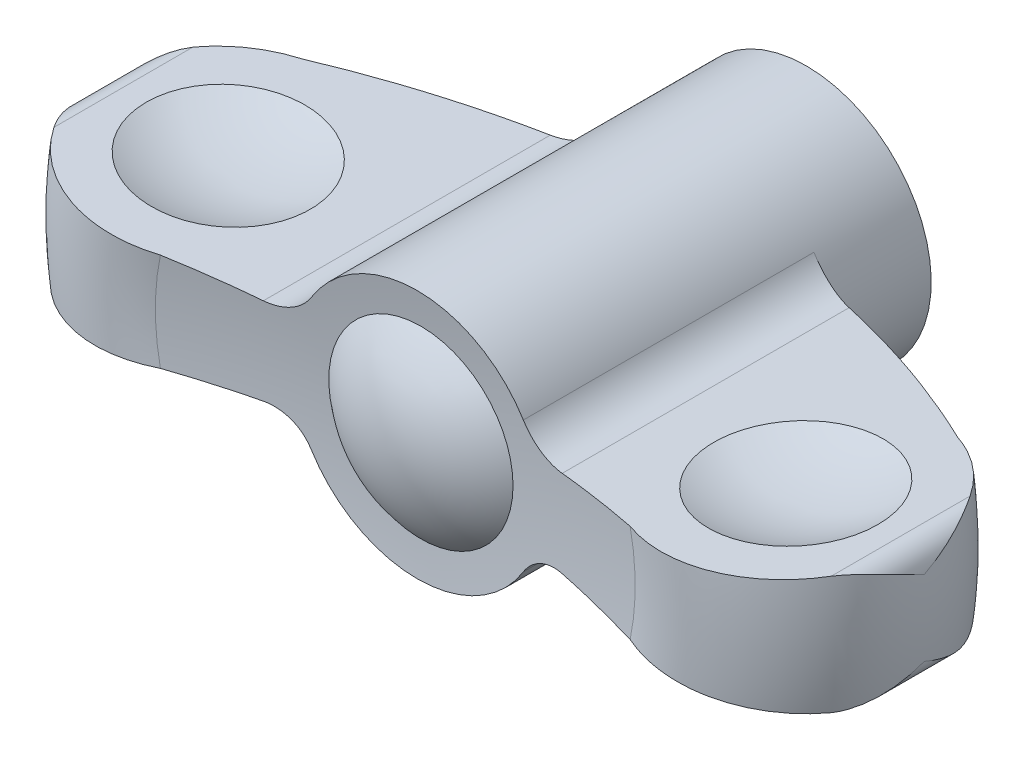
ISO-10303-21;
HEADER;
FILE_DESCRIPTION(('STEP AP214'),'2;1');
FILE_NAME('part.step','',(''),(''),'','','');
FILE_SCHEMA(('AUTOMOTIVE_DESIGN { 1 0 10303 214 1 1 1 1 }'));
ENDSEC;
DATA;
#1=APPLICATION_CONTEXT('core data for automotive mechanical design processes');
#2=APPLICATION_PROTOCOL_DEFINITION('international standard','automotive_design',2000,#1);
#3=PRODUCT_CONTEXT('',#1,'mechanical');
#4=PRODUCT('Part','Part','',(#3));
#5=PRODUCT_RELATED_PRODUCT_CATEGORY('part','',(#4));
#6=PRODUCT_DEFINITION_FORMATION('','',#4);
#7=PRODUCT_DEFINITION_CONTEXT('part definition',#1,'design');
#8=PRODUCT_DEFINITION('design','',#6,#7);
#9=PRODUCT_DEFINITION_SHAPE('','',#8);
#10=(LENGTH_UNIT() NAMED_UNIT(*) SI_UNIT(.MILLI.,.METRE.));
#11=(NAMED_UNIT(*) PLANE_ANGLE_UNIT() SI_UNIT($,.RADIAN.));
#12=(NAMED_UNIT(*) SI_UNIT($,.STERADIAN.) SOLID_ANGLE_UNIT());
#13=UNCERTAINTY_MEASURE_WITH_UNIT(LENGTH_MEASURE(1.E-05),#10,'distance_accuracy_value','');
#14=(GEOMETRIC_REPRESENTATION_CONTEXT(3) GLOBAL_UNCERTAINTY_ASSIGNED_CONTEXT((#13)) GLOBAL_UNIT_ASSIGNED_CONTEXT((#10,
#11,#12)) REPRESENTATION_CONTEXT('',''));
#15=CARTESIAN_POINT('',(0.,0.,0.));
#16=DIRECTION('',(0.,0.,1.));
#17=DIRECTION('',(1.,0.,0.));
#18=AXIS2_PLACEMENT_3D('',#15,#16,#17);
#19=CARTESIAN_POINT('',(0.,0.,29.));
#20=DIRECTION('',(0.,0.,1.));
#21=DIRECTION('',(-1.09310760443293E-09,1.,0.));
#22=AXIS2_PLACEMENT_3D('',#19,#20,#21);
#23=CYLINDRICAL_SURFACE('',#22,7.);
#24=CARTESIAN_POINT('',(0.,0.,26.));
#25=DIRECTION('',(0.,0.,1.));
#26=DIRECTION('',(-1.09310760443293E-09,1.,0.));
#27=AXIS2_PLACEMENT_3D('',#24,#25,#26);
#28=CIRCLE('',#27,7.);
#29=CARTESIAN_POINT('',(-7.65175323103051E-09,7.,26.));
#30=VERTEX_POINT('',#29);
#31=EDGE_CURVE('E9',#30,#30,#28,.T.);
#32=ORIENTED_EDGE('',*,*,#31,.T.);
#33=EDGE_LOOP('',(#32));
#34=FACE_BOUND('',#33,.T.);
#35=CARTESIAN_POINT('',(0.,0.,22.));
#36=DIRECTION('',(0.,0.,1.));
#37=DIRECTION('',(-1.09310760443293E-09,1.,0.));
#38=AXIS2_PLACEMENT_3D('',#35,#36,#37);
#39=CIRCLE('',#38,7.);
#40=CARTESIAN_POINT('',(-7.65175323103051E-09,7.,22.));
#41=VERTEX_POINT('',#40);
#42=EDGE_CURVE('E185',#41,#41,#39,.T.);
#43=ORIENTED_EDGE('',*,*,#42,.F.);
#44=EDGE_LOOP('',(#43));
#45=FACE_BOUND('',#44,.T.);
#46=ADVANCED_FACE('F14',(#34,#45),#23,.F.);
#47=CARTESIAN_POINT('',(-4.,-4.37243009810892E-09,20.));
#48=DIRECTION('',(0.,0.,1.));
#49=DIRECTION('',(-1.09310760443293E-09,1.,0.));
#50=AXIS2_PLACEMENT_3D('',#47,#48,#49);
#51=PLANE('',#50);
#52=CARTESIAN_POINT('',(0.,0.,20.));
#53=DIRECTION('',(0.,0.,1.));
#54=DIRECTION('',(-1.09310760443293E-09,1.,0.));
#55=AXIS2_PLACEMENT_3D('',#52,#53,#54);
#56=CIRCLE('',#55,5.25);
#57=CARTESIAN_POINT('',(-5.73881492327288E-09,5.25,20.));
#58=VERTEX_POINT('',#57);
#59=EDGE_CURVE('E191',#58,#58,#56,.T.);
#60=ORIENTED_EDGE('',*,*,#59,.T.);
#61=EDGE_LOOP('',(#60));
#62=FACE_BOUND('',#61,.T.);
#63=CARTESIAN_POINT('',(0.,0.,20.));
#64=DIRECTION('',(0.,0.,-1.));
#65=DIRECTION('',(1.09310760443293E-09,-1.,0.));
#66=AXIS2_PLACEMENT_3D('',#63,#64,#65);
#67=CIRCLE('',#66,4.);
#68=CARTESIAN_POINT('',(4.37243041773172E-09,-4.,20.));
#69=VERTEX_POINT('',#68);
#70=EDGE_CURVE('E528',#69,#69,#67,.T.);
#71=ORIENTED_EDGE('',*,*,#70,.T.);
#72=EDGE_LOOP('',(#71));
#73=FACE_BOUND('',#72,.T.);
#74=ADVANCED_FACE('F504',(#62,#73),#51,.T.);
#75=CARTESIAN_POINT('',(0.,0.,29.));
#76=DIRECTION('',(0.,0.,1.));
#77=DIRECTION('',(-1.09310760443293E-09,1.,0.));
#78=AXIS2_PLACEMENT_3D('',#75,#76,#77);
#79=CYLINDRICAL_SURFACE('',#78,5.25);
#80=CARTESIAN_POINT('',(0.,0.,22.));
#81=DIRECTION('',(0.,0.,1.));
#82=DIRECTION('',(-1.09310760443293E-09,1.,0.));
#83=AXIS2_PLACEMENT_3D('',#80,#81,#82);
#84=CIRCLE('',#83,5.25);
#85=CARTESIAN_POINT('',(-5.73881492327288E-09,5.25,22.));
#86=VERTEX_POINT('',#85);
#87=EDGE_CURVE('E188',#86,#86,#84,.T.);
#88=ORIENTED_EDGE('',*,*,#87,.T.);
#89=EDGE_LOOP('',(#88));
#90=FACE_BOUND('',#89,.T.);
#91=ORIENTED_EDGE('',*,*,#59,.F.);
#92=EDGE_LOOP('',(#91));
#93=FACE_BOUND('',#92,.T.);
#94=ADVANCED_FACE('F509',(#90,#93),#79,.F.);
#95=CARTESIAN_POINT('',(-5.25,-5.73881480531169E-09,22.));
#96=DIRECTION('',(0.,0.,1.));
#97=DIRECTION('',(-1.09310760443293E-09,1.,0.));
#98=AXIS2_PLACEMENT_3D('',#95,#96,#97);
#99=PLANE('',#98);
#100=ORIENTED_EDGE('',*,*,#42,.T.);
#101=EDGE_LOOP('',(#100));
#102=FACE_BOUND('',#101,.T.);
#103=ORIENTED_EDGE('',*,*,#87,.F.);
#104=EDGE_LOOP('',(#103));
#105=FACE_BOUND('',#104,.T.);
#106=ADVANCED_FACE('F513',(#102,#105),#99,.T.);
#107=CARTESIAN_POINT('',(-5.25,-5.73881480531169E-09,26.));
#108=DIRECTION('',(0.,0.,1.));
#109=DIRECTION('',(-1.09310760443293E-09,1.,0.));
#110=AXIS2_PLACEMENT_3D('',#107,#108,#109);
#111=PLANE('',#110);
#112=ORIENTED_EDGE('',*,*,#31,.F.);
#113=EDGE_LOOP('',(#112));
#114=FACE_BOUND('',#113,.T.);
#115=CARTESIAN_POINT('',(0.,0.,26.));
#116=DIRECTION('',(0.,0.,1.));
#117=DIRECTION('',(-1.09310760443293E-09,1.,0.));
#118=AXIS2_PLACEMENT_3D('',#115,#116,#117);
#119=CIRCLE('',#118,5.25);
#120=CARTESIAN_POINT('',(-5.73881492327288E-09,5.25,26.));
#121=VERTEX_POINT('',#120);
#122=EDGE_CURVE('E534',#121,#121,#119,.T.);
#123=ORIENTED_EDGE('',*,*,#122,.T.);
#124=EDGE_LOOP('',(#123));
#125=FACE_BOUND('',#124,.T.);
#126=ADVANCED_FACE('F516',(#114,#125),#111,.F.);
#127=CARTESIAN_POINT('',(0.,0.,19.6193190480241));
#128=DIRECTION('',(0.,0.,1.));
#129=DIRECTION('',(1.,1.09310760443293E-09,0.));
#130=AXIS2_PLACEMENT_3D('',#127,#128,#129);
#131=SPHERICAL_SURFACE('',#130,10.5431809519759);
#132=CARTESIAN_POINT('',(0.,0.,28.7624128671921));
#133=DIRECTION('',(0.,0.,1.));
#134=DIRECTION('',(-1.09310760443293E-09,1.,0.));
#135=AXIS2_PLACEMENT_3D('',#132,#133,#134);
#136=CIRCLE('',#135,5.25);
#137=CARTESIAN_POINT('',(-5.73881492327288E-09,5.25,28.7624128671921));
#138=VERTEX_POINT('',#137);
#139=EDGE_CURVE('E541',#138,#138,#136,.T.);
#140=ORIENTED_EDGE('',*,*,#139,.F.);
#141=EDGE_LOOP('',(#140));
#142=FACE_BOUND('',#141,.T.);
#143=ADVANCED_FACE('F596',(#142),#131,.F.);
#144=CARTESIAN_POINT('',(0.,0.,32.));
#145=DIRECTION('',(0.,0.,1.));
#146=DIRECTION('',(-1.09310760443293E-09,1.,0.));
#147=AXIS2_PLACEMENT_3D('',#144,#145,#146);
#148=CYLINDRICAL_SURFACE('',#147,5.25);
#149=ORIENTED_EDGE('',*,*,#122,.F.);
#150=EDGE_LOOP('',(#149));
#151=FACE_BOUND('',#150,.T.);
#152=ORIENTED_EDGE('',*,*,#139,.T.);
#153=EDGE_LOOP('',(#152));
#154=FACE_BOUND('',#153,.T.);
#155=ADVANCED_FACE('F599',(#151,#154),#148,.F.);
#156=CARTESIAN_POINT('',(0.,0.,20.));
#157=DIRECTION('',(0.,0.,-1.));
#158=DIRECTION('',(1.09310760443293E-09,-1.,0.));
#159=AXIS2_PLACEMENT_3D('',#156,#157,#158);
#160=CYLINDRICAL_SURFACE('',#159,4.);
#161=ORIENTED_EDGE('',*,*,#70,.F.);
#162=EDGE_LOOP('',(#161));
#163=FACE_BOUND('',#162,.T.);
#164=CARTESIAN_POINT('',(0.,0.,0.));
#165=DIRECTION('',(0.,0.,-1.));
#166=DIRECTION('',(1.09310760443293E-09,-1.,0.));
#167=AXIS2_PLACEMENT_3D('',#164,#165,#166);
#168=CIRCLE('',#167,4.);
#169=CARTESIAN_POINT('',(4.37243041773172E-09,-4.,0.));
#170=VERTEX_POINT('',#169);
#171=EDGE_CURVE('E531',#170,#170,#168,.T.);
#172=ORIENTED_EDGE('',*,*,#171,.T.);
#173=EDGE_LOOP('',(#172));
#174=FACE_BOUND('',#173,.T.);
#175=ADVANCED_FACE('F500',(#163,#174),#160,.F.);
#176=CARTESIAN_POINT('',(20.6909836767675,17.7680454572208,22.4));
#177=DIRECTION('',(0.0653480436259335,-0.997862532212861,0.));
#178=DIRECTION('',(0.997862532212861,0.0653480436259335,0.));
#179=AXIS2_PLACEMENT_3D('',#176,#177,#178);
#180=SPHERICAL_SURFACE('',#179,15.1703703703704);
#181=CARTESIAN_POINT('',(21.5941178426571,3.9772156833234,22.4));
#182=DIRECTION('',(0.0653480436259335,-0.997862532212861,0.));
#183=DIRECTION('',(0.997862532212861,0.0653480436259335,0.));
#184=AXIS2_PLACEMENT_3D('',#181,#182,#183);
#185=CIRCLE('',#184,6.2559971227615);
#186=CARTESIAN_POINT('',(27.8367429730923,4.38603285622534,22.4));
#187=VERTEX_POINT('',#186);
#188=EDGE_CURVE('E544',#187,#187,#185,.T.);
#189=ORIENTED_EDGE('',*,*,#188,.F.);
#190=EDGE_LOOP('',(#189));
#191=FACE_BOUND('',#190,.T.);
#192=ADVANCED_FACE('F493',(#191),#180,.F.);
#193=CARTESIAN_POINT('',(29.5770181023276,2.70000003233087,63.));
#194=DIRECTION('',(0.,0.,-1.));
#195=DIRECTION('',(1.09310760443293E-09,-1.,0.));
#196=AXIS2_PLACEMENT_3D('',#193,#194,#195);
#197=CYLINDRICAL_SURFACE('',#196,1.8);
#198=CARTESIAN_POINT('',(31.3695646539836,2.86363639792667,22.4));
#199=CARTESIAN_POINT('',(31.3693228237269,2.86628562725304,22.3940345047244));
#200=CARTESIAN_POINT('',(31.3690751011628,2.86893441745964,22.3880688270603));
#201=CARTESIAN_POINT('',(31.3455550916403,3.11453947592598,21.8347980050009));
#202=CARTESIAN_POINT('',(31.2727100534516,3.35362325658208,21.2860154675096));
#203=CARTESIAN_POINT('',(31.0906514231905,3.68216343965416,20.4682436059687));
#204=CARTESIAN_POINT('',(31.017776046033,3.78670948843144,20.1964122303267));
#205=CARTESIAN_POINT('',(30.8477677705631,3.98135444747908,19.6550362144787));
#206=CARTESIAN_POINT('',(30.7506472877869,4.07146071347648,19.3854904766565));
#207=CARTESIAN_POINT('',(30.5719332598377,4.20252903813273,18.947067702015));
#208=CARTESIAN_POINT('',(30.4974342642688,4.24947686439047,18.7770506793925));
#209=CARTESIAN_POINT('',(30.3388744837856,4.33328286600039,18.4391221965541));
#210=CARTESIAN_POINT('',(30.2548212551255,4.37014893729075,18.2712091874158));
#211=CARTESIAN_POINT('',(30.0769796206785,4.43174333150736,17.9372486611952));
#212=CARTESIAN_POINT('',(29.9831491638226,4.45641636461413,17.7712129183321));
#213=CARTESIAN_POINT('',(29.8357178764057,4.48201230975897,17.524748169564));
#214=CARTESIAN_POINT('',(29.7853951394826,4.48864310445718,17.4429276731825));
#215=CARTESIAN_POINT('',(29.6826484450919,4.49763628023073,17.2803342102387));
#216=CARTESIAN_POINT('',(29.63022361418,4.49999686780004,17.1995616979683));
#217=CARTESIAN_POINT('',(29.5768181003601,4.50000002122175,17.1194045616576));
#218=B_SPLINE_CURVE_WITH_KNOTS('',3,(#198,#199,#200,#201,#202,#203,#204,#205,#206,#207,#208,
#209,#210,#211,#212,#213,#214,#215,#216,#217),.UNSPECIFIED.,.F.,.F.,(4,2,2,2,2,2,2,2,2,4),(0.,
0.0195959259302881,1.81731826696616,2.7171233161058,3.61646853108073,4.19044381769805,
4.76396827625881,5.34007007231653,5.62881792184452,5.91768701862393),.UNSPECIFIED.);
#219=CARTESIAN_POINT('',(31.3695646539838,2.86363639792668,22.4));
#220=VERTEX_POINT('',#219);
#221=CARTESIAN_POINT('',(29.57701810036,4.50000003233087,17.1197047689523));
#222=VERTEX_POINT('',#221);
#223=EDGE_CURVE('E327',#220,#222,#218,.T.);
#224=ORIENTED_EDGE('',*,*,#223,.T.);
#225=DIRECTION('',(0.,0.,-1.));
#226=VECTOR('',#225,1.);
#227=CARTESIAN_POINT('',(29.57701810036,4.50000003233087,63.));
#228=LINE('',#227,#226);
#229=CARTESIAN_POINT('',(29.57701810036,4.50000003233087,27.6802952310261));
#230=VERTEX_POINT('',#229);
#231=EDGE_CURVE('E451',#230,#222,#228,.T.);
#232=ORIENTED_EDGE('',*,*,#231,.F.);
#233=CARTESIAN_POINT('',(29.57681810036,4.50000002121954,27.6805954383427));
#234=CARTESIAN_POINT('',(29.6191393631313,4.50000105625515,27.6170733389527));
#235=CARTESIAN_POINT('',(29.660848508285,4.4985172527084,27.5531608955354));
#236=CARTESIAN_POINT('',(29.7429683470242,4.49280702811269,27.4246477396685));
#237=CARTESIAN_POINT('',(29.7833793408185,4.48858124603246,27.3600471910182));
#238=CARTESIAN_POINT('',(29.9024609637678,4.47214708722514,27.1655066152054));
#239=CARTESIAN_POINT('',(29.9791105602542,4.4561804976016,27.0346321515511));
#240=CARTESIAN_POINT('',(30.1263186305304,4.41582928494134,26.7715169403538));
#241=CARTESIAN_POINT('',(30.1969002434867,4.3914785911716,26.6392837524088));
#242=CARTESIAN_POINT('',(30.3321494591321,4.33558292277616,26.3732577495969));
#243=CARTESIAN_POINT('',(30.396813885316,4.30403411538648,26.2394641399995));
#244=CARTESIAN_POINT('',(30.562678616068,4.21088538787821,25.8777358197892));
#245=CARTESIAN_POINT('',(30.6582400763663,4.14358643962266,25.6486491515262));
#246=CARTESIAN_POINT('',(30.8316829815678,3.99568955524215,25.1881545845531));
#247=CARTESIAN_POINT('',(30.9095558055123,3.91508516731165,24.9567456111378));
#248=CARTESIAN_POINT('',(31.116683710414,3.65806721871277,24.2592942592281));
#249=CARTESIAN_POINT('',(31.2192514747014,3.46657227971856,23.7904578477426));
#250=CARTESIAN_POINT('',(31.306972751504,3.20184760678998,23.1707445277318));
#251=CARTESIAN_POINT('',(31.3245600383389,3.13661939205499,23.0201631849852));
#252=CARTESIAN_POINT('',(31.3522803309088,3.00489994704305,22.7190103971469));
#253=CARTESIAN_POINT('',(31.3624220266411,2.93841028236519,22.5684391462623));
#254=CARTESIAN_POINT('',(31.3690750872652,2.86893448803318,22.4119313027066));
#255=CARTESIAN_POINT('',(31.3693228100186,2.86628569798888,22.4059656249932));
#256=CARTESIAN_POINT('',(31.3695646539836,2.86363639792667,22.4));
#257=B_SPLINE_CURVE_WITH_KNOTS('',3,(#233,#234,#235,#236,#237,#238,#239,#240,#241,#242,#243,
#244,#245,#246,#247,#248,#249,#250,#251,#252,#253,#254,#255,#256),.UNSPECIFIED.,.F.,.F.,(4,2,2,
2,2,2,2,2,2,2,2,4),(0.,0.228945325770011,0.45783731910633,0.91491838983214,1.37017104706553,
1.82566667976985,2.59598824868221,3.36668444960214,4.90952775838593,5.40460012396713,
5.89909375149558,5.9186896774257),.UNSPECIFIED.);
#258=EDGE_CURVE('E320',#230,#220,#257,.T.);
#259=ORIENTED_EDGE('',*,*,#258,.T.);
#260=EDGE_LOOP('',(#224,#232,#259));
#261=FACE_BOUND('',#260,.T.);
#262=ADVANCED_FACE('F488',(#261),#197,.T.);
#263=CARTESIAN_POINT('',(29.5770181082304,-2.69999996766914,63.));
#264=DIRECTION('',(0.,0.,-1.));
#265=DIRECTION('',(1.09310760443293E-09,-1.,0.));
#266=AXIS2_PLACEMENT_3D('',#263,#264,#265);
#267=CYLINDRICAL_SURFACE('',#266,1.8);
#268=CARTESIAN_POINT('',(31.3695646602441,-2.86363632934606,22.4));
#269=CARTESIAN_POINT('',(31.3693228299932,-2.86628555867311,22.4059654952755));
#270=CARTESIAN_POINT('',(31.3690751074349,-2.86893434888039,22.4119311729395));
#271=CARTESIAN_POINT('',(31.3455550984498,-3.11453940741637,22.9652019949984));
#272=CARTESIAN_POINT('',(31.2727100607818,-3.35362318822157,23.5139845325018));
#273=CARTESIAN_POINT('',(31.0906514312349,-3.68216337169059,24.3317563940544));
#274=CARTESIAN_POINT('',(31.0177760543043,-3.78670942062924,24.6035877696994));
#275=CARTESIAN_POINT('',(30.8477677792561,-3.98135438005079,25.1449637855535));
#276=CARTESIAN_POINT('',(30.7506472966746,-4.07146064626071,25.4145095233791));
#277=CARTESIAN_POINT('',(30.57193326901,-4.202528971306,25.8529322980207));
#278=CARTESIAN_POINT('',(30.4974342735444,-4.24947679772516,26.0229493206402));
#279=CARTESIAN_POINT('',(30.338874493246,-4.3332827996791,26.3608778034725));
#280=CARTESIAN_POINT('',(30.2548212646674,-4.37014887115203,26.5287908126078));
#281=CARTESIAN_POINT('',(30.0769796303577,-4.43174326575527,26.8627513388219));
#282=CARTESIAN_POINT('',(29.9831491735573,-4.45641629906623,27.0287870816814));
#283=CARTESIAN_POINT('',(29.8357178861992,-4.48201224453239,27.2752518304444));
#284=CARTESIAN_POINT('',(29.7853951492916,-4.48864303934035,27.3570723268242));
#285=CARTESIAN_POINT('',(29.6826484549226,-4.49763621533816,27.5196657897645));
#286=CARTESIAN_POINT('',(29.6302236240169,-4.49999680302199,27.6004383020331));
#287=CARTESIAN_POINT('',(29.5768181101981,-4.49999995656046,27.6805954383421));
#288=B_SPLINE_CURVE_WITH_KNOTS('',3,(#268,#269,#270,#271,#272,#273,#274,#275,#276,#277,#278,
#279,#280,#281,#282,#283,#284,#285,#286,#287),.UNSPECIFIED.,.F.,.F.,(4,2,2,2,2,2,2,2,2,4),(0.,
0.0195959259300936,1.81731826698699,2.7171233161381,3.6164685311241,4.19044381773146,
4.76396827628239,5.34007007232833,5.62881792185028,5.91768701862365),.UNSPECIFIED.);
#289=CARTESIAN_POINT('',(31.3695646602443,-2.86363632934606,22.4));
#290=VERTEX_POINT('',#289);
#291=CARTESIAN_POINT('',(29.577018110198,-4.49999996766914,27.6802952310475));
#292=VERTEX_POINT('',#291);
#293=EDGE_CURVE('E313',#290,#292,#288,.T.);
#294=ORIENTED_EDGE('',*,*,#293,.T.);
#295=DIRECTION('',(0.,0.,-1.));
#296=VECTOR('',#295,1.);
#297=CARTESIAN_POINT('',(29.577018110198,-4.49999996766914,63.));
#298=LINE('',#297,#296);
#299=CARTESIAN_POINT('',(29.577018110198,-4.49999996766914,17.1197047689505));
#300=VERTEX_POINT('',#299);
#301=EDGE_CURVE('E435',#292,#300,#298,.T.);
#302=ORIENTED_EDGE('',*,*,#301,.T.);
#303=CARTESIAN_POINT('',(29.576818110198,-4.49999995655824,17.119404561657));
#304=CARTESIAN_POINT('',(29.6191393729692,-4.50000099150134,17.1829266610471));
#305=CARTESIAN_POINT('',(29.6608485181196,-4.4985171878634,17.2468391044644));
#306=CARTESIAN_POINT('',(29.7429683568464,-4.49280696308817,17.3753522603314));
#307=CARTESIAN_POINT('',(29.7833793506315,-4.48858118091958,17.4399528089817));
#308=CARTESIAN_POINT('',(29.9024609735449,-4.47214702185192,17.6344933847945));
#309=CARTESIAN_POINT('',(29.9791105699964,-4.4561804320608,17.765367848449));
#310=CARTESIAN_POINT('',(30.1263186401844,-4.4158292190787,18.0284830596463));
#311=CARTESIAN_POINT('',(30.1969002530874,-4.39147852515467,18.1607162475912));
#312=CARTESIAN_POINT('',(30.3321494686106,-4.33558285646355,18.4267422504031));
#313=CARTESIAN_POINT('',(30.3968138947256,-4.30403404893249,18.5605358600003));
#314=CARTESIAN_POINT('',(30.5626786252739,-4.21088532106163,18.9222641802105));
#315=CARTESIAN_POINT('',(30.658240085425,-4.14358637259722,19.1513508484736));
#316=CARTESIAN_POINT('',(30.8316829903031,-3.9956894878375,19.6118454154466));
#317=CARTESIAN_POINT('',(30.9095558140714,-3.91508509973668,19.8432543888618));
#318=CARTESIAN_POINT('',(31.1166837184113,-3.65806715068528,20.5407057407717));
#319=CARTESIAN_POINT('',(31.2192514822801,-3.46657221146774,21.0095421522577));
#320=CARTESIAN_POINT('',(31.3069727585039,-3.20184753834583,21.6292554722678));
#321=CARTESIAN_POINT('',(31.3245600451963,-3.13661932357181,21.7798368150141));
#322=CARTESIAN_POINT('',(31.3522803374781,-3.0048998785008,22.0809896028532));
#323=CARTESIAN_POINT('',(31.362422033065,-2.93841021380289,22.2315608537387));
#324=CARTESIAN_POINT('',(31.3690750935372,-2.8689344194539,22.3880686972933));
#325=CARTESIAN_POINT('',(31.3693228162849,-2.86628562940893,22.3940343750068));
#326=CARTESIAN_POINT('',(31.3695646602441,-2.86363632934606,22.4));
#327=B_SPLINE_CURVE_WITH_KNOTS('',3,(#303,#304,#305,#306,#307,#308,#309,#310,#311,#312,#313,
#314,#315,#316,#317,#318,#319,#320,#321,#322,#323,#324,#325,#326),.UNSPECIFIED.,.F.,.F.,(4,2,2,
2,2,2,2,2,2,2,2,4),(0.,0.228945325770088,0.457837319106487,0.914918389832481,1.37017104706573,
1.8256666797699,2.59598824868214,3.36668444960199,4.90952775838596,5.40460012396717,
5.8990937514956,5.91868967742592),.UNSPECIFIED.);
#328=EDGE_CURVE('E305',#300,#290,#327,.T.);
#329=ORIENTED_EDGE('',*,*,#328,.T.);
#330=EDGE_LOOP('',(#294,#302,#329));
#331=FACE_BOUND('',#330,.T.);
#332=ADVANCED_FACE('F221',(#331),#267,.T.);
#333=CARTESIAN_POINT('',(20.6909837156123,-17.7680454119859,22.4));
#334=DIRECTION('',(-0.0653480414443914,-0.997862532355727,0.));
#335=DIRECTION('',(0.997862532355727,-0.0653480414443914,0.));
#336=AXIS2_PLACEMENT_3D('',#333,#334,#335);
#337=SPHERICAL_SURFACE('',#336,15.1703703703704);
#338=CARTESIAN_POINT('',(21.5941178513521,-3.97721563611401,22.4));
#339=DIRECTION('',(-0.0653480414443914,-0.997862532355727,0.));
#340=DIRECTION('',(0.997862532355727,-0.0653480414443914,0.));
#341=AXIS2_PLACEMENT_3D('',#338,#339,#340);
#342=CIRCLE('',#341,6.25599712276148);
#343=CARTESIAN_POINT('',(27.836742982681,-4.38603279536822,22.4));
#344=VERTEX_POINT('',#343);
#345=EDGE_CURVE('E547',#344,#344,#342,.T.);
#346=ORIENTED_EDGE('',*,*,#345,.T.);
#347=EDGE_LOOP('',(#346));
#348=FACE_BOUND('',#347,.T.);
#349=ADVANCED_FACE('F361',(#348),#337,.F.);
#350=CARTESIAN_POINT('',(-29.5770181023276,-2.70000003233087,63.));
#351=DIRECTION('',(0.,0.,-1.));
#352=DIRECTION('',(1.09310760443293E-09,-1.,0.));
#353=AXIS2_PLACEMENT_3D('',#350,#351,#352);
#354=CYLINDRICAL_SURFACE('',#353,1.8);
#355=CARTESIAN_POINT('',(-31.3695646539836,-2.86363639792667,22.4));
#356=CARTESIAN_POINT('',(-31.3693228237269,-2.86628562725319,22.3940345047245));
#357=CARTESIAN_POINT('',(-31.3690751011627,-2.86893441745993,22.3880688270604));
#358=CARTESIAN_POINT('',(-31.3455550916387,-3.11453947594,21.8347980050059));
#359=CARTESIAN_POINT('',(-31.2727100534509,-3.35362325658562,21.2860154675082));
#360=CARTESIAN_POINT('',(-31.0906514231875,-3.68216343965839,20.4682436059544));
#361=CARTESIAN_POINT('',(-31.0177760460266,-3.7867094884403,20.1964122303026));
#362=CARTESIAN_POINT('',(-30.8477677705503,-3.98135444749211,19.6550362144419));
#363=CARTESIAN_POINT('',(-30.7506472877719,-4.07146071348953,19.3854904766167));
#364=CARTESIAN_POINT('',(-30.57193326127,-4.20252903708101,18.9470677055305));
#365=CARTESIAN_POINT('',(-30.4974342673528,-4.24947686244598,18.7770506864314));
#366=CARTESIAN_POINT('',(-30.3388744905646,-4.33328286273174,18.4391222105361));
#367=CARTESIAN_POINT('',(-30.2548212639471,-4.37014893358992,18.2712092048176));
#368=CARTESIAN_POINT('',(-30.0769796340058,-4.43174332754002,17.9372486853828));
#369=CARTESIAN_POINT('',(-29.9831491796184,-4.45641636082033,17.7712129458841));
#370=CARTESIAN_POINT('',(-29.8357178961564,-4.48201230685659,17.5247482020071));
#371=CARTESIAN_POINT('',(-29.7853951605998,-4.48864310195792,17.4429277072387));
#372=CARTESIAN_POINT('',(-29.6826484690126,-4.49763627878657,17.2803342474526));
#373=CARTESIAN_POINT('',(-29.6302236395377,-4.49999686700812,17.1995617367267));
#374=CARTESIAN_POINT('',(-29.5768181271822,-4.50000002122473,17.1194046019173));
#375=B_SPLINE_CURVE_WITH_KNOTS('',3,(#355,#356,#357,#358,#359,#360,#361,#362,#363,#364,#365,
#366,#367,#368,#369,#370,#371,#372,#373,#374),.UNSPECIFIED.,.F.,.F.,(4,2,2,2,2,2,2,2,2,4),(0.,
0.0195959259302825,1.81731826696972,2.71712331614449,3.61646853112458,4.19044380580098,
4.76396825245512,5.34007003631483,5.62881787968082,5.91768697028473),.UNSPECIFIED.);
#376=CARTESIAN_POINT('',(-31.3695646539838,-2.86363639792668,22.4));
#377=VERTEX_POINT('',#376);
#378=CARTESIAN_POINT('',(-29.5770181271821,-4.50000003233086,17.1197048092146));
#379=VERTEX_POINT('',#378);
#380=EDGE_CURVE('E22',#377,#379,#375,.T.);
#381=ORIENTED_EDGE('',*,*,#380,.T.);
#382=DIRECTION('',(0.,0.,-1.));
#383=VECTOR('',#382,1.);
#384=CARTESIAN_POINT('',(-29.5770181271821,-4.50000003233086,63.));
#385=LINE('',#384,#383);
#386=CARTESIAN_POINT('',(-29.5770181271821,-4.50000003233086,27.6802951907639));
#387=VERTEX_POINT('',#386);
#388=EDGE_CURVE('E418',#387,#379,#385,.T.);
#389=ORIENTED_EDGE('',*,*,#388,.F.);
#390=CARTESIAN_POINT('',(-29.5768181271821,-4.50000002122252,27.6805953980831));
#391=CARTESIAN_POINT('',(-29.6191393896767,-4.5000010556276,27.6170732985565));
#392=CARTESIAN_POINT('',(-29.6608485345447,-4.49851725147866,27.553160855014));
#393=CARTESIAN_POINT('',(-29.7429683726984,-4.49280702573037,27.4246476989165));
#394=CARTESIAN_POINT('',(-29.7833793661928,-4.48858124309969,27.3600471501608));
#395=CARTESIAN_POINT('',(-29.9024609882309,-4.47214708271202,27.1655065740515));
#396=CARTESIAN_POINT('',(-29.9791105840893,-4.45618049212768,27.0346321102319));
#397=CARTESIAN_POINT('',(-30.1263186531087,-4.41582927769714,26.7715168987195));
#398=CARTESIAN_POINT('',(-30.1969002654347,-4.3914785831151,26.6392837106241));
#399=CARTESIAN_POINT('',(-30.332149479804,-4.3355829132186,26.3732577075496));
#400=CARTESIAN_POINT('',(-30.3968139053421,-4.3040341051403,26.2394640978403));
#401=CARTESIAN_POINT('',(-30.5626786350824,-4.21088537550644,25.8777357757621));
#402=CARTESIAN_POINT('',(-30.6582400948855,-4.14358642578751,25.6486491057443));
#403=CARTESIAN_POINT('',(-30.8316829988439,-3.99568953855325,25.1881545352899));
#404=CARTESIAN_POINT('',(-30.90955582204,-3.9150851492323,24.9567455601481));
#405=CARTESIAN_POINT('',(-31.1166837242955,-3.65806719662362,24.2592942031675));
#406=CARTESIAN_POINT('',(-31.2192514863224,-3.46657225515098,23.7904577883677));
#407=CARTESIAN_POINT('',(-31.3069727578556,-3.2018475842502,23.1707444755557));
#408=CARTESIAN_POINT('',(-31.324560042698,-3.13661937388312,23.0201631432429));
#409=CARTESIAN_POINT('',(-31.3522803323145,-3.00489993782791,22.7190103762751));
#410=CARTESIAN_POINT('',(-31.3624220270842,-2.93841027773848,22.5684391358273));
#411=CARTESIAN_POINT('',(-31.3690750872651,-2.86893448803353,22.4119313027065));
#412=CARTESIAN_POINT('',(-31.3693228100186,-2.86628569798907,22.4059656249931));
#413=CARTESIAN_POINT('',(-31.3695646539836,-2.86363639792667,22.4));
#414=B_SPLINE_CURVE_WITH_KNOTS('',3,(#390,#391,#392,#393,#394,#395,#396,#397,#398,#399,#400,
#401,#402,#403,#404,#405,#406,#407,#408,#409,#410,#411,#412,#413),.UNSPECIFIED.,.F.,.F.,(4,2,2,
2,2,2,2,2,2,2,2,4),(0.,0.228945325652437,0.45783731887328,0.914918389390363,1.37017104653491,
1.82566667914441,2.59598825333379,3.36668445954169,4.9095277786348,5.40460010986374,
5.89909370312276,5.91868962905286),.UNSPECIFIED.);
#415=EDGE_CURVE('E347',#387,#377,#414,.T.);
#416=ORIENTED_EDGE('',*,*,#415,.T.);
#417=EDGE_LOOP('',(#381,#389,#416));
#418=FACE_BOUND('',#417,.T.);
#419=ADVANCED_FACE('F357',(#418),#354,.T.);
#420=CARTESIAN_POINT('',(-20.6909836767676,-17.7680454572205,22.4));
#421=DIRECTION('',(-0.0653480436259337,0.997862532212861,0.));
#422=DIRECTION('',(0.997862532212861,0.0653480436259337,0.));
#423=AXIS2_PLACEMENT_3D('',#420,#421,#422);
#424=SPHERICAL_SURFACE('',#423,15.1703703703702);
#425=CARTESIAN_POINT('',(-21.5941178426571,-3.9772156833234,22.4));
#426=DIRECTION('',(-0.0653480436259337,0.997862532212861,0.));
#427=DIRECTION('',(-0.997862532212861,-0.0653480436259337,0.));
#428=AXIS2_PLACEMENT_3D('',#425,#426,#427);
#429=CIRCLE('',#428,6.25599712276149);
#430=CARTESIAN_POINT('',(-27.8367429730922,-4.38603285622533,22.4));
#431=VERTEX_POINT('',#430);
#432=EDGE_CURVE('E158',#431,#431,#429,.T.);
#433=ORIENTED_EDGE('',*,*,#432,.F.);
#434=EDGE_LOOP('',(#433));
#435=FACE_BOUND('',#434,.T.);
#436=ADVANCED_FACE('F360',(#435),#424,.F.);
#437=CARTESIAN_POINT('',(-29.5770181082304,2.69999996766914,63.));
#438=DIRECTION('',(0.,0.,-1.));
#439=DIRECTION('',(1.09310760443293E-09,-1.,0.));
#440=AXIS2_PLACEMENT_3D('',#437,#438,#439);
#441=CYLINDRICAL_SURFACE('',#440,1.8);
#442=CARTESIAN_POINT('',(-31.3695646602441,2.86363632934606,22.4));
#443=CARTESIAN_POINT('',(-31.3693228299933,2.86628555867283,22.4059654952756));
#444=CARTESIAN_POINT('',(-31.3690751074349,2.86893434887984,22.4119311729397));
#445=CARTESIAN_POINT('',(-31.3455550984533,3.11453940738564,22.9652019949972));
#446=CARTESIAN_POINT('',(-31.2727100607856,3.35362318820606,23.5139845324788));
#447=CARTESIAN_POINT('',(-31.0906514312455,3.68216337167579,24.3317563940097));
#448=CARTESIAN_POINT('',(-31.0177760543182,3.78670942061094,24.6035877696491));
#449=CARTESIAN_POINT('',(-30.8477677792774,3.98135438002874,25.1449637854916));
#450=CARTESIAN_POINT('',(-30.7506472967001,4.07146064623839,25.4145095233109));
#451=CARTESIAN_POINT('',(-30.5719332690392,4.20252897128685,25.8529322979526));
#452=CARTESIAN_POINT('',(-30.4974342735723,4.24947679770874,26.0229493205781));
#453=CARTESIAN_POINT('',(-30.3388744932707,4.33328279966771,26.3608778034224));
#454=CARTESIAN_POINT('',(-30.2548212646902,4.37014887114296,26.5287908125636));
#455=CARTESIAN_POINT('',(-30.0769796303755,4.43174326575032,26.8627513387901));
#456=CARTESIAN_POINT('',(-29.9831491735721,4.45641629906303,27.0287870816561));
#457=CARTESIAN_POINT('',(-29.8357178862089,4.48201224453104,27.2752518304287));
#458=CARTESIAN_POINT('',(-29.7853951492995,4.48864303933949,27.3570723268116));
#459=CARTESIAN_POINT('',(-29.6826484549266,4.49763621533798,27.5196657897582));
#460=CARTESIAN_POINT('',(-29.630223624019,4.49999680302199,27.6004383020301));
#461=CARTESIAN_POINT('',(-29.5768181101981,4.49999995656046,27.6805954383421));
#462=B_SPLINE_CURVE_WITH_KNOTS('',3,(#442,#443,#444,#445,#446,#447,#448,#449,#450,#451,#452,
#453,#454,#455,#456,#457,#458,#459,#460,#461),.UNSPECIFIED.,.F.,.F.,(4,2,2,2,2,2,2,2,2,4),(0.,
0.0195959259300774,1.81731826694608,2.71712331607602,3.61646853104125,4.19044381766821,
4.76396827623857,5.34007007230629,5.62881792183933,5.9176870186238),.UNSPECIFIED.);
#463=CARTESIAN_POINT('',(-31.3695646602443,2.86363632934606,22.4));
#464=VERTEX_POINT('',#463);
#465=CARTESIAN_POINT('',(-29.577018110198,4.49999996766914,27.6802952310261));
#466=VERTEX_POINT('',#465);
#467=EDGE_CURVE('E341',#464,#466,#462,.T.);
#468=ORIENTED_EDGE('',*,*,#467,.T.);
#469=DIRECTION('',(0.,0.,-1.));
#470=VECTOR('',#469,1.);
#471=CARTESIAN_POINT('',(-29.577018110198,4.49999996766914,63.));
#472=LINE('',#471,#470);
#473=CARTESIAN_POINT('',(-29.577018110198,4.49999996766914,17.1197047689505));
#474=VERTEX_POINT('',#473);
#475=EDGE_CURVE('E411',#466,#474,#472,.T.);
#476=ORIENTED_EDGE('',*,*,#475,.T.);
#477=CARTESIAN_POINT('',(-29.576818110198,4.49999995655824,17.119404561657));
#478=CARTESIAN_POINT('',(-29.6191393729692,4.50000099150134,17.1829266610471));
#479=CARTESIAN_POINT('',(-29.6608485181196,4.4985171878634,17.2468391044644));
#480=CARTESIAN_POINT('',(-29.7429683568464,4.49280696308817,17.3753522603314));
#481=CARTESIAN_POINT('',(-29.7833793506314,4.48858118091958,17.4399528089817));
#482=CARTESIAN_POINT('',(-29.9024609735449,4.47214702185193,17.6344933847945));
#483=CARTESIAN_POINT('',(-29.9791105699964,4.4561804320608,17.7653678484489));
#484=CARTESIAN_POINT('',(-30.1263186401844,4.41582921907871,18.0284830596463));
#485=CARTESIAN_POINT('',(-30.1969002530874,4.39147852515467,18.1607162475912));
#486=CARTESIAN_POINT('',(-30.3321494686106,4.33558285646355,18.426742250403));
#487=CARTESIAN_POINT('',(-30.3968138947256,4.30403404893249,18.5605358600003));
#488=CARTESIAN_POINT('',(-30.5626786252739,4.21088532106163,18.9222641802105));
#489=CARTESIAN_POINT('',(-30.658240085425,4.14358637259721,19.1513508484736));
#490=CARTESIAN_POINT('',(-30.8316829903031,3.99568948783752,19.6118454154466));
#491=CARTESIAN_POINT('',(-30.9095558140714,3.91508509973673,19.8432543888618));
#492=CARTESIAN_POINT('',(-31.1166837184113,3.6580671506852,20.5407057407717));
#493=CARTESIAN_POINT('',(-31.2192514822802,3.46657221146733,21.0095421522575));
#494=CARTESIAN_POINT('',(-31.3069727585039,3.20184753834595,21.6292554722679));
#495=CARTESIAN_POINT('',(-31.3245600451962,3.13661932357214,21.7798368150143));
#496=CARTESIAN_POINT('',(-31.3522803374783,3.00489987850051,22.080989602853));
#497=CARTESIAN_POINT('',(-31.3624220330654,2.93841021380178,22.2315608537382));
#498=CARTESIAN_POINT('',(-31.3690750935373,2.86893441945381,22.3880686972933));
#499=CARTESIAN_POINT('',(-31.3693228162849,2.86628562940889,22.3940343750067));
#500=CARTESIAN_POINT('',(-31.3695646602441,2.86363632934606,22.4));
#501=B_SPLINE_CURVE_WITH_KNOTS('',3,(#477,#478,#479,#480,#481,#482,#483,#484,#485,#486,#487,
#488,#489,#490,#491,#492,#493,#494,#495,#496,#497,#498,#499,#500),.UNSPECIFIED.,.F.,.F.,(4,2,2,
2,2,2,2,2,2,2,2,4),(0.,0.228945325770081,0.457837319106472,0.914918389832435,1.37017104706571,
1.8256666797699,2.59598824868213,3.36668444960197,4.90952775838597,5.40460012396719,
5.89909375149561,5.91868967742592),.UNSPECIFIED.);
#502=EDGE_CURVE('E334',#474,#464,#501,.T.);
#503=ORIENTED_EDGE('',*,*,#502,.T.);
#504=EDGE_LOOP('',(#468,#476,#503));
#505=FACE_BOUND('',#504,.T.);
#506=ADVANCED_FACE('F365',(#505),#441,.T.);
#507=CARTESIAN_POINT('',(-20.6909837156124,17.7680454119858,22.4));
#508=DIRECTION('',(0.0653480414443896,0.997862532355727,0.));
#509=DIRECTION('',(-0.997862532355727,0.0653480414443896,0.));
#510=AXIS2_PLACEMENT_3D('',#507,#508,#509);
#511=SPHERICAL_SURFACE('',#510,15.1703703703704);
#512=CARTESIAN_POINT('',(-21.5941178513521,3.97721563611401,22.4));
#513=DIRECTION('',(0.0653480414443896,0.997862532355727,0.));
#514=DIRECTION('',(-0.997862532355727,0.0653480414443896,0.));
#515=AXIS2_PLACEMENT_3D('',#512,#513,#514);
#516=CIRCLE('',#515,6.25599712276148);
#517=CARTESIAN_POINT('',(-27.836742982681,4.3860327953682,22.4));
#518=VERTEX_POINT('',#517);
#519=EDGE_CURVE('E550',#518,#518,#516,.T.);
#520=ORIENTED_EDGE('',*,*,#519,.T.);
#521=EDGE_LOOP('',(#520));
#522=FACE_BOUND('',#521,.T.);
#523=ADVANCED_FACE('F369',(#522),#511,.F.);
#524=CARTESIAN_POINT('',(29.57701810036,4.50000003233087,63.));
#525=DIRECTION('',(0.0653480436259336,-0.997862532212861,0.));
#526=DIRECTION('',(0.997862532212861,0.0653480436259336,0.));
#527=AXIS2_PLACEMENT_3D('',#524,#525,#526);
#528=PLANE('',#527);
#529=ORIENTED_EDGE('',*,*,#188,.T.);
#530=EDGE_LOOP('',(#529));
#531=FACE_BOUND('',#530,.T.);
#532=CARTESIAN_POINT('',(18.1474454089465,3.75149992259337,13.4105144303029));
#533=CARTESIAN_POINT('',(17.890585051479,3.73467864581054,13.5060281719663));
#534=CARTESIAN_POINT('',(17.6377608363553,3.71812168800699,13.6124268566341));
#535=CARTESIAN_POINT('',(17.1419285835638,3.68565061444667,13.846121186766));
#536=CARTESIAN_POINT('',(16.8989202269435,3.66973647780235,13.9734161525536));
#537=CARTESIAN_POINT('',(16.4245099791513,3.63866828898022,14.2479997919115));
#538=CARTESIAN_POINT('',(16.1931050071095,3.62351403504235,14.395283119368));
#539=CARTESIAN_POINT('',(15.7434802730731,3.5940690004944,14.708832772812));
#540=CARTESIAN_POINT('',(15.5252603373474,3.57977820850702,14.875098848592));
#541=CARTESIAN_POINT('',(15.1034606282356,3.55215537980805,15.2255617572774));
#542=CARTESIAN_POINT('',(14.8998888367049,3.53882386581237,15.4097682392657));
#543=CARTESIAN_POINT('',(14.5090032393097,3.51322554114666,15.7947666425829));
#544=CARTESIAN_POINT('',(14.3216896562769,3.50095874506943,15.9955587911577));
#545=CARTESIAN_POINT('',(13.9647725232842,3.47758494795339,16.4122828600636));
#546=CARTESIAN_POINT('',(13.7951642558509,3.46647763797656,16.628210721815));
#547=CARTESIAN_POINT('',(13.4749045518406,3.44550446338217,17.0737519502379));
#548=CARTESIAN_POINT('',(13.3242529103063,3.43563858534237,17.3033651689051));
#549=CARTESIAN_POINT('',(13.043959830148,3.41728274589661,17.7732237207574));
#550=CARTESIAN_POINT('',(12.9141954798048,3.40878473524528,18.0133954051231));
#551=CARTESIAN_POINT('',(12.6756273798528,3.39316138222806,18.5039680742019));
#552=CARTESIAN_POINT('',(12.5668227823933,3.38603598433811,18.7543686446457));
#553=CARTESIAN_POINT('',(12.3710778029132,3.37321703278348,19.2636307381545));
#554=CARTESIAN_POINT('',(12.2841387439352,3.36752356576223,19.5224927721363));
#555=CARTESIAN_POINT('',(12.1328924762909,3.35761874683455,20.0467739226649));
#556=CARTESIAN_POINT('',(12.06858489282,3.35340737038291,20.3121929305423));
#557=CARTESIAN_POINT('',(11.9641647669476,3.34656910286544,20.8426066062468));
#558=CARTESIAN_POINT('',(11.9236219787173,3.34391403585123,21.1075162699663));
#559=CARTESIAN_POINT('',(11.8652424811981,3.34009087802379,21.6398358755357));
#560=CARTESIAN_POINT('',(11.8474054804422,3.33892276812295,21.9072457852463));
#561=CARTESIAN_POINT('',(11.8345982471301,3.33808404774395,22.4425774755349));
#562=CARTESIAN_POINT('',(11.8396248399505,3.33841322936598,22.7104991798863));
#563=CARTESIAN_POINT('',(11.8724923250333,3.34056565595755,23.2449323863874));
#564=CARTESIAN_POINT('',(11.9003330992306,3.34238889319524,23.5114438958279));
#565=CARTESIAN_POINT('',(11.9780680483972,3.34747960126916,24.0376567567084));
#566=CARTESIAN_POINT('',(12.0276696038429,3.35072790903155,24.2974015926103));
#567=CARTESIAN_POINT('',(12.1484267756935,3.35863605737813,24.8118052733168));
#568=CARTESIAN_POINT('',(12.2195821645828,3.36329588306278,25.0664641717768));
#569=CARTESIAN_POINT('',(12.3828443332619,3.37398759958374,25.5689078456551));
#570=CARTESIAN_POINT('',(12.4749485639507,3.38001932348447,25.8166934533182));
#571=CARTESIAN_POINT('',(12.6794078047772,3.3934089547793,26.3038316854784));
#572=CARTESIAN_POINT('',(12.7917703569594,3.40076735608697,26.5431811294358));
#573=CARTESIAN_POINT('',(13.0369078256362,3.41682092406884,27.0137884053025));
#574=CARTESIAN_POINT('',(13.169851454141,3.4255271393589,27.2449579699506));
#575=CARTESIAN_POINT('',(13.4544154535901,3.44416267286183,27.6954567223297));
#576=CARTESIAN_POINT('',(13.606036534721,3.45409203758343,27.9147854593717));
#577=CARTESIAN_POINT('',(13.9268367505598,3.47510060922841,28.3401572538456));
#578=CARTESIAN_POINT('',(14.0960166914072,3.48617986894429,28.5461997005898));
#579=CARTESIAN_POINT('',(14.4507138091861,3.50940828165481,28.9436423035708));
#580=CARTESIAN_POINT('',(14.6362312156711,3.52155744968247,29.135042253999));
#581=CARTESIAN_POINT('',(15.026026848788,3.54708439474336,29.5054914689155));
#582=CARTESIAN_POINT('',(15.2305978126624,3.56048134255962,29.6842314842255));
#583=CARTESIAN_POINT('',(15.6538967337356,3.58820235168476,30.0239900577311));
#584=CARTESIAN_POINT('',(15.8726245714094,3.60252640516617,30.1850087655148));
#585=CARTESIAN_POINT('',(16.3227525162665,3.63200439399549,30.4882695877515));
#586=CARTESIAN_POINT('',(16.5541555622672,3.64715852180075,30.6305073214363));
#587=CARTESIAN_POINT('',(17.0278914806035,3.67818255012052,30.8951425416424));
#588=CARTESIAN_POINT('',(17.270220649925,3.69405220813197,31.0175466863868));
#589=CARTESIAN_POINT('',(17.7669669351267,3.72658313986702,31.2429802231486));
#590=CARTESIAN_POINT('',(18.0214889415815,3.7432512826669,31.3457775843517));
#591=CARTESIAN_POINT('',(18.5382654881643,3.77709395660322,31.5295393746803));
#592=CARTESIAN_POINT('',(18.8005200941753,3.79426849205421,31.6105036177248));
#593=CARTESIAN_POINT('',(19.3309113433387,3.82900276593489,31.7500060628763));
#594=CARTESIAN_POINT('',(19.5990481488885,3.84656251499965,31.808543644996));
#595=CARTESIAN_POINT('',(20.1392890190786,3.88194182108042,31.9027453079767));
#596=CARTESIAN_POINT('',(20.4113930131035,3.89976137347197,31.9384097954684));
#597=CARTESIAN_POINT('',(20.9576381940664,3.93553388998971,31.9865808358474));
#598=CARTESIAN_POINT('',(21.2317794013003,3.95348685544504,31.9990871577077));
#599=CARTESIAN_POINT('',(21.7801364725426,3.98939767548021,32.0008164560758));
#600=CARTESIAN_POINT('',(22.0543523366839,4.00735553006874,31.9900393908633));
#601=CARTESIAN_POINT('',(22.6008596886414,4.04314521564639,31.9452447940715));
#602=CARTESIAN_POINT('',(22.8731513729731,4.06097705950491,31.9112296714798));
#603=CARTESIAN_POINT('',(23.4138724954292,4.09638781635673,31.8201695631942));
#604=CARTESIAN_POINT('',(23.6823019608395,4.11396673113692,31.7631247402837));
#605=CARTESIAN_POINT('',(24.2118784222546,4.14864764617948,31.6267614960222));
#606=CARTESIAN_POINT('',(24.473057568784,4.1657517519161,31.5475684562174));
#607=CARTESIAN_POINT('',(24.9877954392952,4.19946091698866,31.3673123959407));
#608=CARTESIAN_POINT('',(25.2413540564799,4.21606596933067,31.2662490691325));
#609=CARTESIAN_POINT('',(25.7391278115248,4.24866418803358,31.0428965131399));
#610=CARTESIAN_POINT('',(25.9833385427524,4.26465706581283,30.9205974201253));
#611=CARTESIAN_POINT('',(26.4605066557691,4.29590586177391,30.6556646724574));
#612=CARTESIAN_POINT('',(26.6934645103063,4.31116181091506,30.5130318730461));
#613=CARTESIAN_POINT('',(27.1452633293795,4.34074922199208,30.209224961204));
#614=CARTESIAN_POINT('',(27.3641711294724,4.35508506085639,30.0481506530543));
#615=CARTESIAN_POINT('',(27.7875858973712,4.382813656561,29.7080080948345));
#616=CARTESIAN_POINT('',(27.9920934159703,4.39620644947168,29.5289405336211));
#617=CARTESIAN_POINT('',(28.3848624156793,4.42192811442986,29.1544313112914));
#618=CARTESIAN_POINT('',(28.5731528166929,4.43425888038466,28.9590200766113));
#619=CARTESIAN_POINT('',(28.9324617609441,4.45778931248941,28.5530043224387));
#620=CARTESIAN_POINT('',(29.10349081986,4.46898966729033,28.3424091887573));
#621=CARTESIAN_POINT('',(29.3193740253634,4.48312743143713,28.0522910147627));
#622=CARTESIAN_POINT('',(29.3724491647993,4.48660321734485,27.9788119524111));
#623=CARTESIAN_POINT('',(29.4764415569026,4.49341347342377,27.8304567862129));
#624=CARTESIAN_POINT('',(29.5273611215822,4.49674809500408,27.7555823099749));
#625=CARTESIAN_POINT('',(29.57721810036,4.50001312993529,27.6799920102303));
#626=B_SPLINE_CURVE_WITH_KNOTS('',3,(#532,#533,#534,#535,#536,#537,#538,#539,#540,#541,#542,
#543,#544,#545,#546,#547,#548,#549,#550,#551,#552,#553,#554,#555,#556,#557,#558,#559,#560,#561,
#562,#563,#564,#565,#566,#567,#568,#569,#570,#571,#572,#573,#574,#575,#576,#577,#578,#579,#580,
#581,#582,#583,#584,#585,#586,#587,#588,#589,#590,#591,#592,#593,#594,#595,#596,#597,#598,#599,
#600,#601,#602,#603,#604,#605,#606,#607,#608,#609,#610,#611,#612,#613,#614,#615,#616,#617,#618,
#619,#620,#621,#622,#623,#624,#625),.UNSPECIFIED.,.F.,.F.,(4,2,2,2,2,2,2,2,2,2,2,2,2,2,2,2,2,2,
2,2,2,2,2,2,2,2,2,2,2,2,2,2,2,2,2,2,2,2,2,2,2,2,2,2,2,2,4),(0.,0.82342903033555,
1.64683128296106,2.47001373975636,3.29318534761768,4.1168021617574,4.9404302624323,
5.76383834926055,6.58723753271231,7.40559872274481,8.22392680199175,9.04230438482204,
9.86066841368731,10.6637182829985,11.4667578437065,12.2696859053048,13.0726098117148,
13.8650526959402,14.6574872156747,15.449825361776,16.2424591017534,17.0419728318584,
17.8415169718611,18.6410978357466,19.4406899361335,20.2556974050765,21.0706979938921,
21.8858883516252,22.7008044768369,23.5248358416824,24.3488742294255,25.1729353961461,
25.9969819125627,26.8210366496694,27.6450928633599,28.4690636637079,29.2930286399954,
30.112420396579,30.9318236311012,31.7516084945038,32.5713588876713,33.3868657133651,
34.2023413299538,35.0163312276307,35.8298222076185,36.1019244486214,36.3737270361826),.UNSPECIFIED.);
#627=CARTESIAN_POINT('',(17.8721248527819,3.73346972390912,31.2823000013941));
#628=VERTEX_POINT('',#627);
#629=EDGE_CURVE('E267',#628,#230,#626,.T.);
#630=ORIENTED_EDGE('',*,*,#629,.T.);
#631=ORIENTED_EDGE('',*,*,#231,.T.);
#632=CARTESIAN_POINT('',(29.57721810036,4.50001312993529,17.1200079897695));
#633=CARTESIAN_POINT('',(29.4265102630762,4.49014357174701,16.8914517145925));
#634=CARTESIAN_POINT('',(29.265980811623,4.47963081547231,16.6694035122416));
#635=CARTESIAN_POINT('',(28.9265816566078,4.45740423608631,16.2398574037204));
#636=CARTESIAN_POINT('',(28.7477118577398,4.44569040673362,16.0323595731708));
#637=CARTESIAN_POINT('',(28.3777669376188,4.42146344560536,15.6385921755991));
#638=CARTESIAN_POINT('',(28.1871252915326,4.40897870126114,15.451913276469));
#639=CARTESIAN_POINT('',(27.7910307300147,4.38303925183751,15.0951091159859));
#640=CARTESIAN_POINT('',(27.5855798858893,4.36958468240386,14.9249815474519));
#641=CARTESIAN_POINT('',(27.1888740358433,4.34360520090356,14.623387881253));
#642=CARTESIAN_POINT('',(26.9992422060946,4.33118658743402,14.4897704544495));
#643=CARTESIAN_POINT('',(26.6108442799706,4.30575117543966,14.2366062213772));
#644=CARTESIAN_POINT('',(26.4120783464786,4.29273438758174,14.1170591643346));
#645=CARTESIAN_POINT('',(26.0017910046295,4.26586548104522,13.8900697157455));
#646=CARTESIAN_POINT('',(25.7900813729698,4.25200103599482,13.7829689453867));
#647=CARTESIAN_POINT('',(25.3593415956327,4.22379273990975,13.5846713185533));
#648=CARTESIAN_POINT('',(25.1403106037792,4.2094488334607,13.4934763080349));
#649=CARTESIAN_POINT('',(24.9182172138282,4.19490437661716,13.4105144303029));
#650=B_SPLINE_CURVE_WITH_KNOTS('',3,(#632,#633,#634,#635,#636,#637,#638,#639,#640,#641,#642,
#643,#644,#645,#646,#647,#648,#649),.UNSPECIFIED.,.F.,.F.,(4,2,2,2,2,2,2,2,4),(0.,
0.821594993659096,1.64319425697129,2.44361485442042,3.2439237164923,3.94026355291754,
4.63659097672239,5.34893288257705,6.0613574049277),.UNSPECIFIED.);
#651=CARTESIAN_POINT('',(24.918752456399,4.1949394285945,13.4107144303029));
#652=VERTEX_POINT('',#651);
#653=EDGE_CURVE('E29',#222,#652,#650,.T.);
#654=ORIENTED_EDGE('',*,*,#653,.T.);
#655=CARTESIAN_POINT('',(24.9191403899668,4.19496483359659,13.4109144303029));
#656=CARTESIAN_POINT('',(23.8381391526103,4.12417220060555,12.8535823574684));
#657=CARTESIAN_POINT('',(22.7428134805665,4.05244148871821,12.3242059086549));
#658=CARTESIAN_POINT('',(20.5293345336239,3.90748513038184,11.3241128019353));
#659=CARTESIAN_POINT('',(19.4112500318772,3.8342639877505,10.8532432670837));
#660=CARTESIAN_POINT('',(17.1522467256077,3.68632632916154,9.96991193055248));
#661=CARTESIAN_POINT('',(16.0113274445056,3.61160978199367,9.55745134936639));
#662=CARTESIAN_POINT('',(14.2836536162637,3.49846784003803,8.98318373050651));
#663=CARTESIAN_POINT('',(13.7042390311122,3.46052312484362,8.79894257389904));
#664=CARTESIAN_POINT('',(12.5407906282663,3.38433119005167,8.44572577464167));
#665=CARTESIAN_POINT('',(11.9567567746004,3.34608396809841,8.27675025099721));
#666=CARTESIAN_POINT('',(11.370572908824,3.30769594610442,8.115508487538));
#667=B_SPLINE_CURVE_WITH_KNOTS('',3,(#655,#656,#657,#658,#659,#660,#661,#662,#663,#664,#665,
#666),.UNSPECIFIED.,.F.,.F.,(4,2,2,2,2,4),(0.,3.65437061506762,7.29898215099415,
10.9436698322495,12.7710429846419,14.5984303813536),.UNSPECIFIED.);
#668=CARTESIAN_POINT('',(11.370772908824,3.30770904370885,8.1155634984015));
#669=VERTEX_POINT('',#668);
#670=EDGE_CURVE('E202',#652,#669,#667,.T.);
#671=ORIENTED_EDGE('',*,*,#670,.T.);
#672=DIRECTION('',(0.,0.,-1.));
#673=VECTOR('',#672,1.);
#674=CARTESIAN_POINT('',(11.370772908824,3.30770904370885,63.));
#675=LINE('',#674,#673);
#676=CARTESIAN_POINT('',(11.370772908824,3.30770904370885,29.9514557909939));
#677=VERTEX_POINT('',#676);
#678=EDGE_CURVE('E445',#677,#669,#675,.T.);
#679=ORIENTED_EDGE('',*,*,#678,.F.);
#680=CARTESIAN_POINT('',(-0.167132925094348,2.55211441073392,103.170910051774));
#681=DIRECTION('',(0.0653480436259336,-0.997862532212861,0.));
#682=DIRECTION('',(0.997862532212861,0.0653480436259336,0.));
#683=AXIS2_PLACEMENT_3D('',#680,#681,#682);
#684=CIRCLE('',#683,74.1268013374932);
#685=EDGE_CURVE('E425',#628,#677,#684,.F.);
#686=ORIENTED_EDGE('',*,*,#685,.F.);
#687=EDGE_LOOP('',(#630,#631,#654,#671,#679,#686));
#688=FACE_BOUND('',#687,.T.);
#689=ADVANCED_FACE('F250',(#531,#688),#528,.F.);
#690=CARTESIAN_POINT('',(0.,0.,22.4));
#691=DIRECTION('',(0.,0.,1.));
#692=DIRECTION('',(-1.09310760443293E-09,1.,0.));
#693=AXIS2_PLACEMENT_3D('',#690,#691,#692);
#694=TOROIDAL_SURFACE('',#693,21.8999999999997,9.6);
#695=ORIENTED_EDGE('',*,*,#629,.F.);
#696=CARTESIAN_POINT('',(0.,0.,31.2823000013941));
#697=DIRECTION('',(0.,0.,1.));
#698=DIRECTION('',(-1.09310760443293E-09,1.,0.));
#699=AXIS2_PLACEMENT_3D('',#696,#697,#698);
#700=CIRCLE('',#699,18.2579200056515);
#701=CARTESIAN_POINT('',(17.8721248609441,-3.7334696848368,31.2823000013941));
#702=VERTEX_POINT('',#701);
#703=EDGE_CURVE('E181',#702,#628,#700,.T.);
#704=ORIENTED_EDGE('',*,*,#703,.F.);
#705=CARTESIAN_POINT('',(29.577218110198,-4.50001306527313,27.6799920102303));
#706=CARTESIAN_POINT('',(29.4283813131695,-4.49026603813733,27.9057071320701));
#707=CARTESIAN_POINT('',(29.2699701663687,-4.47989200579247,28.1250732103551));
#708=CARTESIAN_POINT('',(28.9352574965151,-4.4579723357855,28.5496181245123));
#709=CARTESIAN_POINT('',(28.7589571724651,-4.44642677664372,28.7547979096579));
#710=CARTESIAN_POINT('',(28.3898682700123,-4.42225587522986,29.1493363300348));
#711=CARTESIAN_POINT('',(28.1970944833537,-4.40963150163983,29.3387088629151));
#712=CARTESIAN_POINT('',(27.7963194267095,-4.38338553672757,29.700509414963));
#713=CARTESIAN_POINT('',(27.5883182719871,-4.36976395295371,29.8729375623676));
#714=CARTESIAN_POINT('',(27.1584989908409,-4.3416159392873,30.1997036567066));
#715=CARTESIAN_POINT('',(26.9366758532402,-4.32708918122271,30.3540349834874));
#716=CARTESIAN_POINT('',(26.4808650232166,-4.29723903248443,30.6434656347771));
#717=CARTESIAN_POINT('',(26.2468771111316,-4.28191562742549,30.7785646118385));
#718=CARTESIAN_POINT('',(25.7684462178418,-4.25058413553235,31.0285776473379));
#719=CARTESIAN_POINT('',(25.5240048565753,-4.23457615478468,31.1434948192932));
#720=CARTESIAN_POINT('',(25.0263706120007,-4.20198707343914,31.3523874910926));
#721=CARTESIAN_POINT('',(24.7731777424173,-4.18540597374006,31.446363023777));
#722=CARTESIAN_POINT('',(24.2590478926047,-4.15173662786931,31.612996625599));
#723=CARTESIAN_POINT('',(23.9980896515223,-4.13464698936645,31.6855888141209));
#724=CARTESIAN_POINT('',(23.4709078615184,-4.10012289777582,31.8086173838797));
#725=CARTESIAN_POINT('',(23.2046821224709,-4.08268830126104,31.8590443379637));
#726=CARTESIAN_POINT('',(22.6689091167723,-4.04760158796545,31.9373839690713));
#727=CARTESIAN_POINT('',(22.399361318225,-4.02994943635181,31.9652929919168));
#728=CARTESIAN_POINT('',(21.858996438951,-3.99456201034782,31.9984159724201));
#729=CARTESIAN_POINT('',(21.588179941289,-3.97682677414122,32.003639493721));
#730=CARTESIAN_POINT('',(21.0454404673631,-3.94128384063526,31.9913795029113));
#731=CARTESIAN_POINT('',(20.7735205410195,-3.92347634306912,31.9737602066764));
#732=CARTESIAN_POINT('',(20.232112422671,-3.88802059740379,31.9157373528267));
#733=CARTESIAN_POINT('',(19.9626242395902,-3.87037234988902,31.8753337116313));
#734=CARTESIAN_POINT('',(19.4280257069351,-3.83536255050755,31.7720671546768));
#735=CARTESIAN_POINT('',(19.1629144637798,-3.81800094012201,31.7092088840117));
#736=CARTESIAN_POINT('',(18.6387730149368,-3.78367595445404,31.5614710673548));
#737=CARTESIAN_POINT('',(18.3797450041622,-3.76671272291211,31.4765837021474));
#738=CARTESIAN_POINT('',(17.8682212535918,-3.73321404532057,31.2848646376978));
#739=CARTESIAN_POINT('',(17.6157711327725,-3.7166815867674,31.1779106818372));
#740=CARTESIAN_POINT('',(17.1207308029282,-3.68426237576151,30.9431230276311));
#741=CARTESIAN_POINT('',(16.878140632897,-3.66837562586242,30.8152892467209));
#742=CARTESIAN_POINT('',(16.4045275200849,-3.63735964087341,30.5396362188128));
#743=CARTESIAN_POINT('',(16.1735051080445,-3.62223044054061,30.3918160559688));
#744=CARTESIAN_POINT('',(15.7246795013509,-3.59283774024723,30.0772205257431));
#745=CARTESIAN_POINT('',(15.5068766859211,-3.57857426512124,29.9104446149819));
#746=CARTESIAN_POINT('',(15.0856203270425,-3.55098702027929,29.5587225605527));
#747=CARTESIAN_POINT('',(14.8821981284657,-3.53766530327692,29.3737387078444));
#748=CARTESIAN_POINT('',(14.4917116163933,-3.51209311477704,28.9871837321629));
#749=CARTESIAN_POINT('',(14.3046468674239,-3.49984261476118,28.7856130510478));
#750=CARTESIAN_POINT('',(13.948272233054,-3.47650434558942,28.367276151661));
#751=CARTESIAN_POINT('',(13.7789624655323,-3.46541658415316,28.1505098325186));
#752=CARTESIAN_POINT('',(13.4594078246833,-3.44448958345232,27.7032976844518));
#753=CARTESIAN_POINT('',(13.3091626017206,-3.43465032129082,27.4728521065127));
#754=CARTESIAN_POINT('',(13.0300075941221,-3.416369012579,27.0017206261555));
#755=CARTESIAN_POINT('',(12.9009427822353,-3.40791681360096,26.7611269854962));
#756=CARTESIAN_POINT('',(12.6638563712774,-3.39239049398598,26.2698561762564));
#757=CARTESIAN_POINT('',(12.55582645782,-3.38531582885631,26.0191830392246));
#758=CARTESIAN_POINT('',(12.3616487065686,-3.37259951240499,25.5094385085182));
#759=CARTESIAN_POINT('',(12.2755026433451,-3.36695797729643,25.2503664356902));
#760=CARTESIAN_POINT('',(12.1258566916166,-3.35715796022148,24.7257346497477));
#761=CARTESIAN_POINT('',(12.0623564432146,-3.35299945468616,24.4601750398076));
#762=CARTESIAN_POINT('',(11.9595441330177,-3.34626648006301,23.9295575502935));
#763=CARTESIAN_POINT('',(11.9198013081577,-3.34366380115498,23.6645834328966));
#764=CARTESIAN_POINT('',(11.8630211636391,-3.33994538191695,23.1322038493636));
#765=CARTESIAN_POINT('',(11.8459835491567,-3.33882962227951,22.8647984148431));
#766=CARTESIAN_POINT('',(11.8347668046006,-3.33809505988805,22.3295252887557));
#767=CARTESIAN_POINT('',(11.8405861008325,-3.33847615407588,22.061657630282));
#768=CARTESIAN_POINT('',(11.875027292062,-3.34073163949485,21.5273997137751));
#769=CARTESIAN_POINT('',(11.9036490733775,-3.34260602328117,21.2610094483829));
#770=CARTESIAN_POINT('',(11.9829240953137,-3.3477975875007,20.7350583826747));
#771=CARTESIAN_POINT('',(12.0332886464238,-3.35109586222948,20.475453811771));
#772=CARTESIAN_POINT('',(12.1555550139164,-3.35910284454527,19.9613934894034));
#773=CARTESIAN_POINT('',(12.2274566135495,-3.36381153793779,19.7069376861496));
#774=CARTESIAN_POINT('',(12.3921774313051,-3.37459877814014,19.2049950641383));
#775=CARTESIAN_POINT('',(12.4849912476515,-3.38067697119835,18.9575064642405));
#776=CARTESIAN_POINT('',(12.6908448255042,-3.39415791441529,18.4709993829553));
#777=CARTESIAN_POINT('',(12.8038936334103,-3.40156125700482,18.2319847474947));
#778=CARTESIAN_POINT('',(13.0503991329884,-3.41770441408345,17.7620583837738));
#779=CARTESIAN_POINT('',(13.1840279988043,-3.42645550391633,17.5312373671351));
#780=CARTESIAN_POINT('',(13.4698675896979,-3.44517457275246,17.0815911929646));
#781=CARTESIAN_POINT('',(13.6220707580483,-3.4551420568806,16.8627612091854));
#782=CARTESIAN_POINT('',(13.9440945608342,-3.47623075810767,16.4382825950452));
#783=CARTESIAN_POINT('',(14.1139279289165,-3.48735280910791,16.2326436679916));
#784=CARTESIAN_POINT('',(14.4698944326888,-3.51066435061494,15.8360721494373));
#785=CARTESIAN_POINT('',(14.6560271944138,-3.52285381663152,15.6451392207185));
#786=CARTESIAN_POINT('',(15.0471805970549,-3.54846967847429,15.2755429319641));
#787=CARTESIAN_POINT('',(15.2525053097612,-3.56191598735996,15.0972026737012));
#788=CARTESIAN_POINT('',(15.6772923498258,-3.58973444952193,14.7583242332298));
#789=CARTESIAN_POINT('',(15.8967545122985,-3.60410659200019,14.5977858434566));
#790=CARTESIAN_POINT('',(16.347893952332,-3.63365082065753,14.2958496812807));
#791=CARTESIAN_POINT('',(16.5795509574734,-3.648821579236,14.1544214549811));
#792=CARTESIAN_POINT('',(17.053703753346,-3.67987290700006,13.8914238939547));
#793=CARTESIAN_POINT('',(17.2961933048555,-3.69575306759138,13.7698433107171));
#794=CARTESIAN_POINT('',(17.6425873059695,-3.71843772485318,13.6138611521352));
#795=CARTESIAN_POINT('',(17.7426773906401,-3.72499242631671,13.5707938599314));
#796=CARTESIAN_POINT('',(17.9441132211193,-3.73818406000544,13.4880908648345));
#797=CARTESIAN_POINT('',(18.0454572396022,-3.74482087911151,13.4484509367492));
#798=CARTESIAN_POINT('',(18.1474454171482,-3.75149988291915,13.4105144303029));
#799=B_SPLINE_CURVE_WITH_KNOTS('',3,(#705,#706,#707,#708,#709,#710,#711,#712,#713,#714,#715,
#716,#717,#718,#719,#720,#721,#722,#723,#724,#725,#726,#727,#728,#729,#730,#731,#732,#733,#734,
#735,#736,#737,#738,#739,#740,#741,#742,#743,#744,#745,#746,#747,#748,#749,#750,#751,#752,#753,
#754,#755,#756,#757,#758,#759,#760,#761,#762,#763,#764,#765,#766,#767,#768,#769,#770,#771,#772,
#773,#774,#775,#776,#777,#778,#779,#780,#781,#782,#783,#784,#785,#786,#787,#788,#789,#790,#791,
#792,#793,#794,#795,#796,#797,#798),.UNSPECIFIED.,.F.,.F.,(4,2,2,2,2,2,2,2,2,2,2,2,2,2,2,2,2,2,
2,2,2,2,2,2,2,2,2,2,2,2,2,2,2,2,2,2,2,2,2,2,2,2,2,2,2,2,4),(0.,0.811383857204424,
1.62271336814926,2.43332187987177,3.2439242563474,4.05482224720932,4.86573488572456,
5.6765223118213,6.48730846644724,7.3005670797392,8.11417124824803,8.92790742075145,
9.74130050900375,10.5595508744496,11.3778042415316,12.1958884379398,13.0142634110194,
13.8373004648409,14.6603407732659,15.4834188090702,16.3065204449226,17.1313641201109,
17.9561858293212,18.7810130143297,19.6058250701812,20.4243011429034,21.242453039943,
22.0606712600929,22.8788764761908,23.6817568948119,24.4846268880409,25.2874416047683,
26.0902523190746,26.8827166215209,27.6751729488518,28.4674248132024,29.2600317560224,
30.0596712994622,30.8589865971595,31.6588832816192,32.4587616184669,33.2746912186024,
34.0906113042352,34.905215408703,35.7193562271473,36.0467859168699,36.3738060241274),.UNSPECIFIED.);
#800=EDGE_CURVE('E235',#292,#702,#799,.T.);
#801=ORIENTED_EDGE('',*,*,#800,.F.);
#802=ORIENTED_EDGE('',*,*,#293,.F.);
#803=ORIENTED_EDGE('',*,*,#328,.F.);
#804=CARTESIAN_POINT('',(24.9182172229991,-4.19490432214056,13.4105144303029));
#805=CARTESIAN_POINT('',(25.1747287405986,-4.21170275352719,13.5063205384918));
#806=CARTESIAN_POINT('',(25.4271515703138,-4.22823342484,13.6131252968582));
#807=CARTESIAN_POINT('',(25.9220334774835,-4.26064226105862,13.847863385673));
#808=CARTESIAN_POINT('',(26.1644920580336,-4.27652039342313,13.9757977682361));
#809=CARTESIAN_POINT('',(26.6315223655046,-4.30710528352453,14.2483504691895));
#810=CARTESIAN_POINT('',(26.8563943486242,-4.32183170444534,14.3924524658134));
#811=CARTESIAN_POINT('',(27.2933789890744,-4.35044896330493,14.6988790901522));
#812=CARTESIAN_POINT('',(27.5054935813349,-4.36433992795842,14.8612009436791));
#813=CARTESIAN_POINT('',(27.8883161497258,-4.38941021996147,15.1803070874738));
#814=CARTESIAN_POINT('',(28.0607864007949,-4.40070495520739,15.3349749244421));
#815=CARTESIAN_POINT('',(28.3941147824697,-4.42253397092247,15.6563910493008));
#816=CARTESIAN_POINT('',(28.5549737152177,-4.43306830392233,15.8231385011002));
#817=CARTESIAN_POINT('',(28.8677866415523,-4.45355380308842,16.171824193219));
#818=CARTESIAN_POINT('',(29.0194509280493,-4.463485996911,16.3540235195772));
#819=CARTESIAN_POINT('',(29.3089338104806,-4.4824436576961,16.7291933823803));
#820=CARTESIAN_POINT('',(29.4467504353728,-4.49146899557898,16.9221654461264));
#821=CARTESIAN_POINT('',(29.577218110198,-4.50001306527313,17.1200079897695));
#822=B_SPLINE_CURVE_WITH_KNOTS('',3,(#804,#805,#806,#807,#808,#809,#810,#811,#812,#813,#814,
#815,#816,#817,#818,#819,#820,#821),.UNSPECIFIED.,.F.,.F.,(4,2,2,2,2,2,2,2,4),(0.,
0.82275942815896,1.64555983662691,2.44710662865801,3.24853154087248,3.9437587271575,
4.63893783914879,5.35009750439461,6.06135825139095),.UNSPECIFIED.);
#823=CARTESIAN_POINT('',(24.9187524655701,-4.19493937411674,13.4107144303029));
#824=VERTEX_POINT('',#823);
#825=EDGE_CURVE('E229',#824,#300,#822,.T.);
#826=ORIENTED_EDGE('',*,*,#825,.F.);
#827=CARTESIAN_POINT('',(0.,0.,13.4107144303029));
#828=DIRECTION('',(0.,0.,1.));
#829=DIRECTION('',(-1.09310760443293E-09,1.,0.));
#830=AXIS2_PLACEMENT_3D('',#827,#828,#829);
#831=CIRCLE('',#830,25.2693834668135);
#832=EDGE_CURVE('E177',#824,#652,#831,.T.);
#833=ORIENTED_EDGE('',*,*,#832,.T.);
#834=ORIENTED_EDGE('',*,*,#653,.F.);
#835=ORIENTED_EDGE('',*,*,#223,.F.);
#836=ORIENTED_EDGE('',*,*,#258,.F.);
#837=EDGE_LOOP('',(#695,#704,#801,#802,#803,#826,#833,#834,#835,#836));
#838=FACE_BOUND('',#837,.T.);
#839=ADVANCED_FACE('F219',(#838),#694,.T.);
#840=CARTESIAN_POINT('',(11.3707729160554,-3.3077090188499,63.));
#841=DIRECTION('',(0.0653480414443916,0.997862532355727,0.));
#842=DIRECTION('',(-0.997862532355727,0.0653480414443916,0.));
#843=AXIS2_PLACEMENT_3D('',#840,#841,#842);
#844=PLANE('',#843);
#845=ORIENTED_EDGE('',*,*,#345,.F.);
#846=EDGE_LOOP('',(#845));
#847=FACE_BOUND('',#846,.T.);
#848=DIRECTION('',(0.,0.,-1.));
#849=VECTOR('',#848,1.);
#850=CARTESIAN_POINT('',(11.3707729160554,-3.3077090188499,63.));
#851=LINE('',#850,#849);
#852=CARTESIAN_POINT('',(11.3707729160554,-3.3077090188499,29.9514557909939));
#853=VERTEX_POINT('',#852);
#854=CARTESIAN_POINT('',(11.3707729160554,-3.3077090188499,8.11556349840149));
#855=VERTEX_POINT('',#854);
#856=EDGE_CURVE('E142',#853,#855,#851,.T.);
#857=ORIENTED_EDGE('',*,*,#856,.T.);
#858=CARTESIAN_POINT('',(11.3705729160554,-3.3076959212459,8.11550848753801));
#859=CARTESIAN_POINT('',(13.3194357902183,-3.43532309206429,8.65165350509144));
#860=CARTESIAN_POINT('',(15.2454387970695,-3.56145321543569,9.27335320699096));
#861=CARTESIAN_POINT('',(19.0285581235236,-3.80920220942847,10.6774595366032));
#862=CARTESIAN_POINT('',(20.8859409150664,-3.93083853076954,11.4591449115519));
#863=CARTESIAN_POINT('',(23.0778618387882,-4.07438309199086,12.4939591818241));
#864=CARTESIAN_POINT('',(23.4481408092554,-4.09863192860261,12.6727423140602));
#865=CARTESIAN_POINT('',(24.1858660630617,-4.14694409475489,13.0369148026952));
#866=CARTESIAN_POINT('',(24.5533094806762,-4.17100723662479,13.2223099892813));
#867=CARTESIAN_POINT('',(24.9191403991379,-4.19496477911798,13.4109144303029));
#868=B_SPLINE_CURVE_WITH_KNOTS('',3,(#858,#859,#860,#861,#862,#863,#864,#865,#866,#867),
.UNSPECIFIED.,.F.,.F.,(4,2,2,2,4),(0.,6.07517314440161,12.1235385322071,13.3591937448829,
14.5959668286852),.UNSPECIFIED.);
#869=EDGE_CURVE('E194',#855,#824,#868,.T.);
#870=ORIENTED_EDGE('',*,*,#869,.T.);
#871=ORIENTED_EDGE('',*,*,#825,.T.);
#872=ORIENTED_EDGE('',*,*,#301,.F.);
#873=ORIENTED_EDGE('',*,*,#800,.T.);
#874=CARTESIAN_POINT('',(-0.167132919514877,-2.55211441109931,103.170910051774));
#875=DIRECTION('',(0.0653480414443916,0.997862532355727,0.));
#876=DIRECTION('',(-0.997862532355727,0.0653480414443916,0.));
#877=AXIS2_PLACEMENT_3D('',#874,#875,#876);
#878=CIRCLE('',#877,74.1268013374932);
#879=EDGE_CURVE('E431',#853,#702,#878,.F.);
#880=ORIENTED_EDGE('',*,*,#879,.F.);
#881=EDGE_LOOP('',(#857,#870,#871,#872,#873,#880));
#882=FACE_BOUND('',#881,.T.);
#883=ADVANCED_FACE('F213',(#847,#882),#844,.F.);
#884=CARTESIAN_POINT('',(0.,0.,21.456819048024));
#885=DIRECTION('',(0.,0.,1.));
#886=DIRECTION('',(1.,1.09310760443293E-09,0.));
#887=AXIS2_PLACEMENT_3D('',#884,#885,#886);
#888=SPHERICAL_SURFACE('',#887,10.5431809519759);
#889=CARTESIAN_POINT('',(0.,0.,29.3320056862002));
#890=DIRECTION('',(0.,0.,1.));
#891=DIRECTION('',(-1.09310760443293E-09,1.,0.));
#892=AXIS2_PLACEMENT_3D('',#889,#890,#891);
#893=CIRCLE('',#892,7.01);
#894=CARTESIAN_POINT('',(-7.66268430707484E-09,7.01,29.3320056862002));
#895=VERTEX_POINT('',#894);
#896=EDGE_CURVE('E530',#895,#895,#893,.T.);
#897=ORIENTED_EDGE('',*,*,#896,.T.);
#898=EDGE_LOOP('',(#897));
#899=FACE_BOUND('',#898,.T.);
#900=ADVANCED_FACE('F218',(#899),#888,.T.);
#901=CARTESIAN_POINT('',(-18.1474454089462,-3.75149992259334,13.4105144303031));
#902=CARTESIAN_POINT('',(-17.8905850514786,-3.73467864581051,13.5060281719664));
#903=CARTESIAN_POINT('',(-17.637760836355,-3.71812168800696,13.6124268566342));
#904=CARTESIAN_POINT('',(-17.1419285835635,-3.68565061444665,13.8461211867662));
#905=CARTESIAN_POINT('',(-16.8989202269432,-3.66973647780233,13.9734161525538));
#906=CARTESIAN_POINT('',(-16.424509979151,-3.63866828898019,14.2479997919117));
#907=CARTESIAN_POINT('',(-16.1931050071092,-3.62351403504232,14.3952831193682));
#908=CARTESIAN_POINT('',(-15.7434802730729,-3.59406900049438,14.7088327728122));
#909=CARTESIAN_POINT('',(-15.5252603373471,-3.579778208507,14.8750988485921));
#910=CARTESIAN_POINT('',(-15.1034606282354,-3.55215537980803,15.2255617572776));
#911=CARTESIAN_POINT('',(-14.8998888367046,-3.53882386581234,15.409768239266));
#912=CARTESIAN_POINT('',(-14.5090032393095,-3.51322554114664,15.7947666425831));
#913=CARTESIAN_POINT('',(-14.3216896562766,-3.50095874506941,15.995558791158));
#914=CARTESIAN_POINT('',(-13.964772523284,-3.47758494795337,16.4122828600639));
#915=CARTESIAN_POINT('',(-13.7951642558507,-3.46647763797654,16.6282107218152));
#916=CARTESIAN_POINT('',(-13.4749045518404,-3.44550446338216,17.0737519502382));
#917=CARTESIAN_POINT('',(-13.3242529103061,-3.43563858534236,17.3033651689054));
#918=CARTESIAN_POINT('',(-13.0439598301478,-3.41728274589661,17.7732237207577));
#919=CARTESIAN_POINT('',(-12.9141954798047,-3.40878473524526,18.0133954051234));
#920=CARTESIAN_POINT('',(-12.6756273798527,-3.39316138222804,18.5039680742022));
#921=CARTESIAN_POINT('',(-12.5668227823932,-3.3860359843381,18.754368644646));
#922=CARTESIAN_POINT('',(-12.3710778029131,-3.37321703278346,19.2636307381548));
#923=CARTESIAN_POINT('',(-12.284138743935,-3.36752356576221,19.5224927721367));
#924=CARTESIAN_POINT('',(-12.1328924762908,-3.35761874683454,20.0467739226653));
#925=CARTESIAN_POINT('',(-12.06858489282,-3.35340737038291,20.3121929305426));
#926=CARTESIAN_POINT('',(-11.9641647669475,-3.34656910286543,20.8426066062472));
#927=CARTESIAN_POINT('',(-11.9236219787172,-3.34391403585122,21.1075162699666));
#928=CARTESIAN_POINT('',(-11.8652424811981,-3.34009087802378,21.639835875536));
#929=CARTESIAN_POINT('',(-11.8474054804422,-3.33892276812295,21.9072457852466));
#930=CARTESIAN_POINT('',(-11.8345982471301,-3.33808404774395,22.4425774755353));
#931=CARTESIAN_POINT('',(-11.8396248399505,-3.33841322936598,22.7104991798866));
#932=CARTESIAN_POINT('',(-11.8724923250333,-3.34056565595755,23.2449323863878));
#933=CARTESIAN_POINT('',(-11.9003330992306,-3.34238889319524,23.5114438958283));
#934=CARTESIAN_POINT('',(-11.9780680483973,-3.34747960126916,24.0376567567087));
#935=CARTESIAN_POINT('',(-12.027669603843,-3.35072790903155,24.2974015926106));
#936=CARTESIAN_POINT('',(-12.1484267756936,-3.35863605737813,24.8118052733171));
#937=CARTESIAN_POINT('',(-12.2195821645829,-3.36329588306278,25.0664641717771));
#938=CARTESIAN_POINT('',(-12.382844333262,-3.37398759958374,25.5689078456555));
#939=CARTESIAN_POINT('',(-12.4749485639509,-3.38001932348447,25.8166934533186));
#940=CARTESIAN_POINT('',(-12.6794078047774,-3.3934089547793,26.3038316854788));
#941=CARTESIAN_POINT('',(-12.7917703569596,-3.40076735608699,26.5431811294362));
#942=CARTESIAN_POINT('',(-13.0369078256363,-3.41682092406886,27.0137884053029));
#943=CARTESIAN_POINT('',(-13.1698514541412,-3.42552713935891,27.2449579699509));
#944=CARTESIAN_POINT('',(-13.4544154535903,-3.44416267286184,27.69545672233));
#945=CARTESIAN_POINT('',(-13.6060365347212,-3.45409203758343,27.914785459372));
#946=CARTESIAN_POINT('',(-13.9268367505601,-3.47510060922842,28.3401572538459));
#947=CARTESIAN_POINT('',(-14.0960166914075,-3.4861798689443,28.5461997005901));
#948=CARTESIAN_POINT('',(-14.4507138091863,-3.50940828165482,28.9436423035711));
#949=CARTESIAN_POINT('',(-14.6362312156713,-3.52155744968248,29.1350422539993));
#950=CARTESIAN_POINT('',(-15.0260268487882,-3.54708439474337,29.5054914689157));
#951=CARTESIAN_POINT('',(-15.2305978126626,-3.56048134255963,29.6842314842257));
#952=CARTESIAN_POINT('',(-15.6538967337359,-3.58820235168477,30.0239900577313));
#953=CARTESIAN_POINT('',(-15.8726245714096,-3.60252640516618,30.1850087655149));
#954=CARTESIAN_POINT('',(-16.3227525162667,-3.6320043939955,30.4882695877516));
#955=CARTESIAN_POINT('',(-16.5541555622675,-3.64715852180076,30.6305073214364));
#956=CARTESIAN_POINT('',(-17.0278914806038,-3.67818255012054,30.8951425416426));
#957=CARTESIAN_POINT('',(-17.2702206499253,-3.69405220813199,31.017546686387));
#958=CARTESIAN_POINT('',(-17.7669669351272,-3.72658313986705,31.2429802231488));
#959=CARTESIAN_POINT('',(-18.0214889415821,-3.74325128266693,31.3457775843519));
#960=CARTESIAN_POINT('',(-18.5382654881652,-3.77709395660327,31.5295393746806));
#961=CARTESIAN_POINT('',(-18.8005200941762,-3.79426849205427,31.6105036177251));
#962=CARTESIAN_POINT('',(-19.3309113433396,-3.82900276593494,31.7500060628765));
#963=CARTESIAN_POINT('',(-19.5990481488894,-3.8465625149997,31.8085436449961));
#964=CARTESIAN_POINT('',(-20.1392890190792,-3.88194182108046,31.9027453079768));
#965=CARTESIAN_POINT('',(-20.411393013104,-3.899761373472,31.9384097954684));
#966=CARTESIAN_POINT('',(-20.9576381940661,-3.93553388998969,31.9865808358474));
#967=CARTESIAN_POINT('',(-21.2317794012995,-3.95348685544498,31.9990871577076));
#968=CARTESIAN_POINT('',(-21.7801364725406,-3.98939767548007,32.0008164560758));
#969=CARTESIAN_POINT('',(-22.0543523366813,-4.00735553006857,31.9900393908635));
#970=CARTESIAN_POINT('',(-22.6008596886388,-4.04314521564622,31.9452447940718));
#971=CARTESIAN_POINT('',(-22.8731513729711,-4.06097705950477,31.9112296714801));
#972=CARTESIAN_POINT('',(-23.4138724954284,-4.09638781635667,31.8201695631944));
#973=CARTESIAN_POINT('',(-23.6823019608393,-4.11396673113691,31.7631247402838));
#974=CARTESIAN_POINT('',(-24.2118784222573,-4.14864764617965,31.6267614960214));
#975=CARTESIAN_POINT('',(-24.4730575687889,-4.16575175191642,31.5475684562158));
#976=CARTESIAN_POINT('',(-24.9877954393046,-4.19946091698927,31.3673123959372));
#977=CARTESIAN_POINT('',(-25.2413540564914,-4.21606596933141,31.2662490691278));
#978=CARTESIAN_POINT('',(-25.7391278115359,-4.2486641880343,31.0428965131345));
#979=CARTESIAN_POINT('',(-25.983338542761,-4.26465706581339,30.9205974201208));
#980=CARTESIAN_POINT('',(-26.4605066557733,-4.29590586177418,30.6556646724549));
#981=CARTESIAN_POINT('',(-26.6934645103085,-4.31116181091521,30.5130318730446));
#982=CARTESIAN_POINT('',(-27.1452633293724,-4.34074922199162,30.2092249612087));
#983=CARTESIAN_POINT('',(-27.3641711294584,-4.35508506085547,30.0481506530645));
#984=CARTESIAN_POINT('',(-27.7875858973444,-4.38281365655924,29.708008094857));
#985=CARTESIAN_POINT('',(-27.9920934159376,-4.39620644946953,29.5289405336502));
#986=CARTESIAN_POINT('',(-28.3848624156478,-4.42192811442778,29.1544313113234));
#987=CARTESIAN_POINT('',(-28.5731528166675,-4.43425888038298,28.9590200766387));
#988=CARTESIAN_POINT('',(-28.9324617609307,-4.45778931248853,28.5530043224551));
#989=CARTESIAN_POINT('',(-29.1034908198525,-4.46898966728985,28.3424091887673));
#990=CARTESIAN_POINT('',(-29.3193740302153,-4.48312743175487,28.0522910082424));
#991=CARTESIAN_POINT('',(-29.3724491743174,-4.48660321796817,27.978811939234));
#992=CARTESIAN_POINT('',(-29.476441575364,-4.49341347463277,27.8304567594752));
#993=CARTESIAN_POINT('',(-29.5273611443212,-4.49674809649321,27.7555822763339));
#994=CARTESIAN_POINT('',(-29.5772181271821,-4.50001313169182,27.6799919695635));
#995=B_SPLINE_CURVE_WITH_KNOTS('',3,(#901,#902,#903,#904,#905,#906,#907,#908,#909,#910,#911,
#912,#913,#914,#915,#916,#917,#918,#919,#920,#921,#922,#923,#924,#925,#926,#927,#928,#929,#930,
#931,#932,#933,#934,#935,#936,#937,#938,#939,#940,#941,#942,#943,#944,#945,#946,#947,#948,#949,
#950,#951,#952,#953,#954,#955,#956,#957,#958,#959,#960,#961,#962,#963,#964,#965,#966,#967,#968,
#969,#970,#971,#972,#973,#974,#975,#976,#977,#978,#979,#980,#981,#982,#983,#984,#985,#986,#987,
#988,#989,#990,#991,#992,#993,#994),.UNSPECIFIED.,.F.,.F.,(4,2,2,2,2,2,2,2,2,2,2,2,2,2,2,2,2,2,
2,2,2,2,2,2,2,2,2,2,2,2,2,2,2,2,2,2,2,2,2,2,2,2,2,2,2,2,4),(0.,0.823429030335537,
1.64683128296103,2.47001373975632,3.29318534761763,4.11680216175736,4.94043026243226,
5.76383834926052,6.5872375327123,7.40559872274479,8.22392680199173,9.04230438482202,
9.8606684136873,10.6637182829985,11.4667578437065,12.2696859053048,13.0726098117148,
13.8650526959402,14.6574872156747,15.449825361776,16.2424591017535,17.0419728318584,
17.8415169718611,18.6410978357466,19.4406899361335,20.2556974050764,21.070697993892,
21.8858883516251,22.7008044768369,23.5248358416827,24.3488742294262,25.1729353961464,
25.9969819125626,26.8210366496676,27.6450928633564,28.4690636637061,29.2930286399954,
30.1124203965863,30.9318236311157,31.7516084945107,32.5713588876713,33.3868657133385,
34.2023413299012,35.0163312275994,35.8298222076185,36.1019244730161,36.3737270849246),.UNSPECIFIED.);
#996=CARTESIAN_POINT('',(-17.8721248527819,-3.73346972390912,31.2823000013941));
#997=VERTEX_POINT('',#996);
#998=EDGE_CURVE('E170',#997,#387,#995,.T.);
#999=ORIENTED_EDGE('',*,*,#998,.F.);
#1000=CARTESIAN_POINT('',(-17.8721248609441,3.7334696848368,31.2823000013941));
#1001=VERTEX_POINT('',#1000);
#1002=EDGE_CURVE('E182',#1001,#997,#700,.T.);
#1003=ORIENTED_EDGE('',*,*,#1002,.F.);
#1004=CARTESIAN_POINT('',(-29.5772181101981,4.50001306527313,27.6799920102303));
#1005=CARTESIAN_POINT('',(-29.4283813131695,4.49026603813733,27.9057071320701));
#1006=CARTESIAN_POINT('',(-29.2699701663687,4.47989200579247,28.125073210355));
#1007=CARTESIAN_POINT('',(-28.9352574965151,4.4579723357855,28.5496181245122));
#1008=CARTESIAN_POINT('',(-28.7589571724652,4.44642677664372,28.7547979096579));
#1009=CARTESIAN_POINT('',(-28.3898682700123,4.42225587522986,29.1493363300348));
#1010=CARTESIAN_POINT('',(-28.1970944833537,4.40963150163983,29.3387088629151));
#1011=CARTESIAN_POINT('',(-27.7963194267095,4.38338553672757,29.700509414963));
#1012=CARTESIAN_POINT('',(-27.5883182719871,4.36976395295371,29.8729375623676));
#1013=CARTESIAN_POINT('',(-27.1584989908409,4.3416159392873,30.1997036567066));
#1014=CARTESIAN_POINT('',(-26.9366758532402,4.32708918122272,30.3540349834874));
#1015=CARTESIAN_POINT('',(-26.4808650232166,4.29723903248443,30.6434656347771));
#1016=CARTESIAN_POINT('',(-26.2468771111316,4.28191562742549,30.7785646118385));
#1017=CARTESIAN_POINT('',(-25.7684462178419,4.25058413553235,31.0285776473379));
#1018=CARTESIAN_POINT('',(-25.5240048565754,4.23457615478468,31.1434948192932));
#1019=CARTESIAN_POINT('',(-25.0263706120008,4.20198707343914,31.3523874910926));
#1020=CARTESIAN_POINT('',(-24.7731777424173,4.18540597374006,31.446363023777));
#1021=CARTESIAN_POINT('',(-24.2590478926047,4.1517366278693,31.612996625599));
#1022=CARTESIAN_POINT('',(-23.9980896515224,4.13464698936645,31.6855888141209));
#1023=CARTESIAN_POINT('',(-23.4709078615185,4.10012289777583,31.8086173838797));
#1024=CARTESIAN_POINT('',(-23.2046821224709,4.08268830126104,31.8590443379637));
#1025=CARTESIAN_POINT('',(-22.6689091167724,4.04760158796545,31.9373839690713));
#1026=CARTESIAN_POINT('',(-22.399361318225,4.02994943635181,31.9652929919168));
#1027=CARTESIAN_POINT('',(-21.858996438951,3.99456201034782,31.9984159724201));
#1028=CARTESIAN_POINT('',(-21.5881799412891,3.97682677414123,32.003639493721));
#1029=CARTESIAN_POINT('',(-21.0454404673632,3.94128384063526,31.9913795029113));
#1030=CARTESIAN_POINT('',(-20.7735205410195,3.92347634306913,31.9737602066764));
#1031=CARTESIAN_POINT('',(-20.232112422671,3.88802059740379,31.9157373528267));
#1032=CARTESIAN_POINT('',(-19.9626242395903,3.87037234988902,31.8753337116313));
#1033=CARTESIAN_POINT('',(-19.4280257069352,3.83536255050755,31.7720671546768));
#1034=CARTESIAN_POINT('',(-19.1629144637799,3.81800094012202,31.7092088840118));
#1035=CARTESIAN_POINT('',(-18.6387730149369,3.78367595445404,31.5614710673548));
#1036=CARTESIAN_POINT('',(-18.3797450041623,3.76671272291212,31.4765837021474));
#1037=CARTESIAN_POINT('',(-17.8682212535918,3.73321404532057,31.2848646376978));
#1038=CARTESIAN_POINT('',(-17.6157711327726,3.7166815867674,31.1779106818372));
#1039=CARTESIAN_POINT('',(-17.1207308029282,3.68426237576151,30.9431230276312));
#1040=CARTESIAN_POINT('',(-16.878140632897,3.66837562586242,30.815289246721));
#1041=CARTESIAN_POINT('',(-16.404527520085,3.63735964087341,30.5396362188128));
#1042=CARTESIAN_POINT('',(-16.1735051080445,3.62223044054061,30.3918160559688));
#1043=CARTESIAN_POINT('',(-15.7246795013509,3.59283774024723,30.0772205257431));
#1044=CARTESIAN_POINT('',(-15.5068766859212,3.57857426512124,29.9104446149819));
#1045=CARTESIAN_POINT('',(-15.0856203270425,3.55098702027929,29.5587225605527));
#1046=CARTESIAN_POINT('',(-14.8821981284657,3.53766530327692,29.3737387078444));
#1047=CARTESIAN_POINT('',(-14.4917116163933,3.51209311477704,28.9871837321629));
#1048=CARTESIAN_POINT('',(-14.3046468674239,3.49984261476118,28.7856130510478));
#1049=CARTESIAN_POINT('',(-13.948272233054,3.47650434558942,28.367276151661));
#1050=CARTESIAN_POINT('',(-13.7789624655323,3.46541658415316,28.1505098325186));
#1051=CARTESIAN_POINT('',(-13.4594078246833,3.44448958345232,27.7032976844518));
#1052=CARTESIAN_POINT('',(-13.3091626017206,3.43465032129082,27.4728521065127));
#1053=CARTESIAN_POINT('',(-13.0300075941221,3.416369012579,27.0017206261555));
#1054=CARTESIAN_POINT('',(-12.9009427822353,3.40791681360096,26.7611269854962));
#1055=CARTESIAN_POINT('',(-12.6638563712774,3.39239049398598,26.2698561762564));
#1056=CARTESIAN_POINT('',(-12.55582645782,3.38531582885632,26.0191830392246));
#1057=CARTESIAN_POINT('',(-12.3616487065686,3.37259951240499,25.5094385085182));
#1058=CARTESIAN_POINT('',(-12.2755026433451,3.36695797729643,25.2503664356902));
#1059=CARTESIAN_POINT('',(-12.1258566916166,3.35715796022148,24.7257346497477));
#1060=CARTESIAN_POINT('',(-12.0623564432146,3.35299945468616,24.4601750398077));
#1061=CARTESIAN_POINT('',(-11.9595441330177,3.34626648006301,23.9295575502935));
#1062=CARTESIAN_POINT('',(-11.9198013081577,3.34366380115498,23.6645834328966));
#1063=CARTESIAN_POINT('',(-11.8630211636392,3.33994538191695,23.1322038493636));
#1064=CARTESIAN_POINT('',(-11.8459835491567,3.33882962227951,22.8647984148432));
#1065=CARTESIAN_POINT('',(-11.8347668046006,3.33809505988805,22.3295252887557));
#1066=CARTESIAN_POINT('',(-11.8405861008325,3.33847615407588,22.0616576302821));
#1067=CARTESIAN_POINT('',(-11.875027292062,3.34073163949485,21.5273997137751));
#1068=CARTESIAN_POINT('',(-11.9036490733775,3.34260602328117,21.2610094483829));
#1069=CARTESIAN_POINT('',(-11.9829240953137,3.3477975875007,20.7350583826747));
#1070=CARTESIAN_POINT('',(-12.0332886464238,3.35109586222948,20.475453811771));
#1071=CARTESIAN_POINT('',(-12.1555550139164,3.35910284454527,19.9613934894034));
#1072=CARTESIAN_POINT('',(-12.2274566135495,3.36381153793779,19.7069376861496));
#1073=CARTESIAN_POINT('',(-12.3921774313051,3.37459877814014,19.2049950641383));
#1074=CARTESIAN_POINT('',(-12.4849912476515,3.38067697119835,18.9575064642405));
#1075=CARTESIAN_POINT('',(-12.6908448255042,3.39415791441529,18.4709993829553));
#1076=CARTESIAN_POINT('',(-12.8038936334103,3.40156125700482,18.2319847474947));
#1077=CARTESIAN_POINT('',(-13.0503991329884,3.41770441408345,17.7620583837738));
#1078=CARTESIAN_POINT('',(-13.1840279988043,3.42645550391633,17.5312373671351));
#1079=CARTESIAN_POINT('',(-13.4698675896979,3.44517457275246,17.0815911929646));
#1080=CARTESIAN_POINT('',(-13.6220707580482,3.4551420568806,16.8627612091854));
#1081=CARTESIAN_POINT('',(-13.9440945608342,3.47623075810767,16.4382825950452));
#1082=CARTESIAN_POINT('',(-14.1139279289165,3.48735280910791,16.2326436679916));
#1083=CARTESIAN_POINT('',(-14.4698944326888,3.51066435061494,15.8360721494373));
#1084=CARTESIAN_POINT('',(-14.6560271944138,3.52285381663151,15.6451392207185));
#1085=CARTESIAN_POINT('',(-15.0471805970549,3.54846967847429,15.2755429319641));
#1086=CARTESIAN_POINT('',(-15.2525053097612,3.56191598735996,15.0972026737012));
#1087=CARTESIAN_POINT('',(-15.6772923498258,3.58973444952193,14.7583242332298));
#1088=CARTESIAN_POINT('',(-15.8967545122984,3.60410659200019,14.5977858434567));
#1089=CARTESIAN_POINT('',(-16.3478939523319,3.63365082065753,14.2958496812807));
#1090=CARTESIAN_POINT('',(-16.5795509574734,3.648821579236,14.1544214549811));
#1091=CARTESIAN_POINT('',(-17.0537037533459,3.67987290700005,13.8914238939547));
#1092=CARTESIAN_POINT('',(-17.2961933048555,3.69575306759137,13.7698433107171));
#1093=CARTESIAN_POINT('',(-17.6425873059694,3.71843772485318,13.6138611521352));
#1094=CARTESIAN_POINT('',(-17.74267739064,3.7249924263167,13.5707938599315));
#1095=CARTESIAN_POINT('',(-17.9441132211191,3.73818406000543,13.4880908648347));
#1096=CARTESIAN_POINT('',(-18.0454572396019,3.74482087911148,13.4484509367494));
#1097=CARTESIAN_POINT('',(-18.1474454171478,3.75149988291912,13.4105144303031));
#1098=B_SPLINE_CURVE_WITH_KNOTS('',3,(#1004,#1005,#1006,#1007,#1008,#1009,#1010,#1011,#1012,
#1013,#1014,#1015,#1016,#1017,#1018,#1019,#1020,#1021,#1022,#1023,#1024,#1025,#1026,#1027,#1028,
#1029,#1030,#1031,#1032,#1033,#1034,#1035,#1036,#1037,#1038,#1039,#1040,#1041,#1042,#1043,#1044,
#1045,#1046,#1047,#1048,#1049,#1050,#1051,#1052,#1053,#1054,#1055,#1056,#1057,#1058,#1059,#1060,
#1061,#1062,#1063,#1064,#1065,#1066,#1067,#1068,#1069,#1070,#1071,#1072,#1073,#1074,#1075,#1076,
#1077,#1078,#1079,#1080,#1081,#1082,#1083,#1084,#1085,#1086,#1087,#1088,#1089,#1090,#1091,#1092,
#1093,#1094,#1095,#1096,#1097),.UNSPECIFIED.,.F.,.F.,(4,2,2,2,2,2,2,2,2,2,2,2,2,2,2,2,2,2,2,2,2,
2,2,2,2,2,2,2,2,2,2,2,2,2,2,2,2,2,2,2,2,2,2,2,2,2,4),(0.,0.81138385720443,1.62271336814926,
2.43332187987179,3.24392425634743,4.05482224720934,4.86573488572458,5.6765223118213,
6.48730846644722,7.30056707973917,8.11417124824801,8.92790742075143,9.74130050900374,
10.5595508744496,11.3778042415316,12.1958884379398,13.0142634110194,13.8373004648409,
14.6603407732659,15.4834188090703,16.3065204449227,17.131364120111,17.9561858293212,
18.7810130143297,19.6058250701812,20.4243011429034,21.242453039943,22.0606712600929,
22.8788764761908,23.6817568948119,24.4846268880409,25.2874416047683,26.0902523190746,
26.8827166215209,27.6751729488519,28.4674248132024,29.2600317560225,30.0596712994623,
30.8589865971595,31.6588832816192,32.4587616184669,33.2746912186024,34.0906113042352,
34.905215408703,35.7193562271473,36.0467859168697,36.373806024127),.UNSPECIFIED.);
#1099=EDGE_CURVE('E284',#466,#1001,#1098,.T.);
#1100=ORIENTED_EDGE('',*,*,#1099,.F.);
#1101=ORIENTED_EDGE('',*,*,#467,.F.);
#1102=ORIENTED_EDGE('',*,*,#502,.F.);
#1103=CARTESIAN_POINT('',(-24.9182172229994,4.19490432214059,13.4105144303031));
#1104=CARTESIAN_POINT('',(-25.174728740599,4.21170275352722,13.506320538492));
#1105=CARTESIAN_POINT('',(-25.4271515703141,4.22823342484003,13.6131252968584));
#1106=CARTESIAN_POINT('',(-25.9220334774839,4.26064226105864,13.8478633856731));
#1107=CARTESIAN_POINT('',(-26.1644920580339,4.27652039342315,13.9757977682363));
#1108=CARTESIAN_POINT('',(-26.6315223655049,4.30710528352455,14.2483504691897));
#1109=CARTESIAN_POINT('',(-26.8563943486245,4.32183170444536,14.3924524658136));
#1110=CARTESIAN_POINT('',(-27.2933789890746,4.35044896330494,14.6988790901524));
#1111=CARTESIAN_POINT('',(-27.5054935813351,4.36433992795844,14.8612009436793));
#1112=CARTESIAN_POINT('',(-27.888316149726,4.38941021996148,15.1803070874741));
#1113=CARTESIAN_POINT('',(-28.0607864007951,4.40070495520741,15.3349749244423));
#1114=CARTESIAN_POINT('',(-28.3941147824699,4.42253397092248,15.656391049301));
#1115=CARTESIAN_POINT('',(-28.5549737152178,4.43306830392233,15.8231385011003));
#1116=CARTESIAN_POINT('',(-28.8677866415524,4.45355380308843,16.1718241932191));
#1117=CARTESIAN_POINT('',(-29.0194509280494,4.463485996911,16.3540235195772));
#1118=CARTESIAN_POINT('',(-29.3089338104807,4.4824436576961,16.7291933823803));
#1119=CARTESIAN_POINT('',(-29.4467504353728,4.49146899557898,16.9221654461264));
#1120=CARTESIAN_POINT('',(-29.577218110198,4.50001306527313,17.1200079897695));
#1121=B_SPLINE_CURVE_WITH_KNOTS('',3,(#1103,#1104,#1105,#1106,#1107,#1108,#1109,#1110,#1111,
#1112,#1113,#1114,#1115,#1116,#1117,#1118,#1119,#1120),.UNSPECIFIED.,.F.,.F.,(4,2,2,2,2,2,2,2,
4),(0.,0.822759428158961,1.64555983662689,2.44710662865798,3.24853154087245,3.94375872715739,
4.6389378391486,5.35009750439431,6.06135825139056),.UNSPECIFIED.);
#1122=CARTESIAN_POINT('',(-24.9187524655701,4.19493937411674,13.4107144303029));
#1123=VERTEX_POINT('',#1122);
#1124=EDGE_CURVE('E275',#1123,#474,#1121,.T.);
#1125=ORIENTED_EDGE('',*,*,#1124,.F.);
#1126=CARTESIAN_POINT('',(-24.918752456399,-4.1949394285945,13.4107144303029));
#1127=VERTEX_POINT('',#1126);
#1128=EDGE_CURVE('E178',#1123,#1127,#831,.T.);
#1129=ORIENTED_EDGE('',*,*,#1128,.T.);
#1130=CARTESIAN_POINT('',(-29.5772181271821,-4.50001313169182,17.1200080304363));
#1131=CARTESIAN_POINT('',(-29.4265102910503,-4.49014357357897,16.8914517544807));
#1132=CARTESIAN_POINT('',(-29.2659808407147,-4.47963081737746,16.6694035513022));
#1133=CARTESIAN_POINT('',(-28.9265816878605,-4.45740423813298,16.2398574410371));
#1134=CARTESIAN_POINT('',(-28.7477118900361,-4.44569040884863,16.032359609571));
#1135=CARTESIAN_POINT('',(-28.3777669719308,-4.42146344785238,15.6385922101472));
#1136=CARTESIAN_POINT('',(-28.1871253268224,-4.40897870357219,15.4519133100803));
#1137=CARTESIAN_POINT('',(-27.7910307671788,-4.38303925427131,15.0951091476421));
#1138=CARTESIAN_POINT('',(-27.5855799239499,-4.36958468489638,14.92498157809));
#1139=CARTESIAN_POINT('',(-27.1888740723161,-4.3436052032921,14.6233879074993));
#1140=CARTESIAN_POINT('',(-26.9992422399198,-4.33118658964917,14.4897704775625));
#1141=CARTESIAN_POINT('',(-26.6108443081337,-4.305751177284,14.2366062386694));
#1142=CARTESIAN_POINT('',(-26.4120783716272,-4.29273438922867,14.1170591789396));
#1143=CARTESIAN_POINT('',(-26.0017910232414,-4.26586548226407,13.8900697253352));
#1144=CARTESIAN_POINT('',(-25.7900813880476,-4.25200103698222,13.7829689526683));
#1145=CARTESIAN_POINT('',(-25.3593416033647,-4.22379274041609,13.5846713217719));
#1146=CARTESIAN_POINT('',(-25.1403106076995,-4.20944883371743,13.4934763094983));
#1147=CARTESIAN_POINT('',(-24.9182172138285,-4.19490437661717,13.4105144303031));
#1148=B_SPLINE_CURVE_WITH_KNOTS('',3,(#1130,#1131,#1132,#1133,#1134,#1135,#1136,#1137,#1138,
#1139,#1140,#1141,#1142,#1143,#1144,#1145,#1146,#1147),.UNSPECIFIED.,.F.,.F.,(4,2,2,2,2,2,2,2,
4),(0.,0.821594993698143,1.64319425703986,2.44361485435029,3.24392371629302,3.94026356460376,
4.63659100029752,5.34893291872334,6.06135745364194),.UNSPECIFIED.);
#1149=EDGE_CURVE('E292',#379,#1127,#1148,.T.);
#1150=ORIENTED_EDGE('',*,*,#1149,.F.);
#1151=ORIENTED_EDGE('',*,*,#380,.F.);
#1152=ORIENTED_EDGE('',*,*,#415,.F.);
#1153=EDGE_LOOP('',(#999,#1003,#1100,#1101,#1102,#1125,#1129,#1150,#1151,#1152));
#1154=FACE_BOUND('',#1153,.T.);
#1155=ADVANCED_FACE('F252',(#1154),#694,.T.);
#1156=CARTESIAN_POINT('',(-29.57701810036,-4.50000003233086,63.));
#1157=DIRECTION('',(-0.0653480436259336,0.997862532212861,0.));
#1158=DIRECTION('',(-0.997862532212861,-0.0653480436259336,0.));
#1159=AXIS2_PLACEMENT_3D('',#1156,#1157,#1158);
#1160=PLANE('',#1159);
#1161=ORIENTED_EDGE('',*,*,#432,.T.);
#1162=EDGE_LOOP('',(#1161));
#1163=FACE_BOUND('',#1162,.T.);
#1164=ORIENTED_EDGE('',*,*,#998,.T.);
#1165=ORIENTED_EDGE('',*,*,#388,.T.);
#1166=ORIENTED_EDGE('',*,*,#1149,.T.);
#1167=CARTESIAN_POINT('',(-24.9191403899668,-4.19496483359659,13.4109144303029));
#1168=CARTESIAN_POINT('',(-23.8381391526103,-4.12417220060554,12.8535823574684));
#1169=CARTESIAN_POINT('',(-22.7428134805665,-4.05244148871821,12.3242059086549));
#1170=CARTESIAN_POINT('',(-20.5293345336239,-3.90748513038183,11.3241128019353));
#1171=CARTESIAN_POINT('',(-19.4112500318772,-3.83426398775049,10.8532432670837));
#1172=CARTESIAN_POINT('',(-17.1522467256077,-3.68632632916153,9.96991193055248));
#1173=CARTESIAN_POINT('',(-16.0113274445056,-3.61160978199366,9.55745134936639));
#1174=CARTESIAN_POINT('',(-14.2836536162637,-3.49846784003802,8.98318373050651));
#1175=CARTESIAN_POINT('',(-13.7042390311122,-3.46052312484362,8.79894257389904));
#1176=CARTESIAN_POINT('',(-12.5407906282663,-3.38433119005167,8.44572577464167));
#1177=CARTESIAN_POINT('',(-11.9567567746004,-3.34608396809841,8.27675025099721));
#1178=CARTESIAN_POINT('',(-11.370572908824,-3.30769594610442,8.115508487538));
#1179=B_SPLINE_CURVE_WITH_KNOTS('',3,(#1167,#1168,#1169,#1170,#1171,#1172,#1173,#1174,#1175,
#1176,#1177,#1178),.UNSPECIFIED.,.F.,.F.,(4,2,2,2,2,4),(0.,3.65437061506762,7.29898215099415,
10.9436698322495,12.7710429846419,14.5984303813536),.UNSPECIFIED.);
#1180=CARTESIAN_POINT('',(-11.370772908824,-3.30770904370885,8.11556349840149));
#1181=VERTEX_POINT('',#1180);
#1182=EDGE_CURVE('E389',#1127,#1181,#1179,.T.);
#1183=ORIENTED_EDGE('',*,*,#1182,.T.);
#1184=DIRECTION('',(0.,0.,-1.));
#1185=VECTOR('',#1184,1.);
#1186=CARTESIAN_POINT('',(-11.370772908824,-3.30770904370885,63.));
#1187=LINE('',#1186,#1185);
#1188=CARTESIAN_POINT('',(-11.370772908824,-3.30770904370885,29.951455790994));
#1189=VERTEX_POINT('',#1188);
#1190=EDGE_CURVE('E462',#1189,#1181,#1187,.T.);
#1191=ORIENTED_EDGE('',*,*,#1190,.F.);
#1192=CARTESIAN_POINT('',(0.167132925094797,-2.55211441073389,103.170910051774));
#1193=DIRECTION('',(-0.0653480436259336,0.997862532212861,0.));
#1194=DIRECTION('',(-0.997862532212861,-0.0653480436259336,0.));
#1195=AXIS2_PLACEMENT_3D('',#1192,#1193,#1194);
#1196=CIRCLE('',#1195,74.1268013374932);
#1197=EDGE_CURVE('E166',#997,#1189,#1196,.F.);
#1198=ORIENTED_EDGE('',*,*,#1197,.F.);
#1199=EDGE_LOOP('',(#1164,#1165,#1166,#1183,#1191,#1198));
#1200=FACE_BOUND('',#1199,.T.);
#1201=ADVANCED_FACE('F363',(#1163,#1200),#1160,.F.);
#1202=CARTESIAN_POINT('',(-11.3707729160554,3.3077090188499,63.));
#1203=DIRECTION('',(-0.0653480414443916,-0.997862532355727,0.));
#1204=DIRECTION('',(0.997862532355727,-0.0653480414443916,0.));
#1205=AXIS2_PLACEMENT_3D('',#1202,#1203,#1204);
#1206=PLANE('',#1205);
#1207=ORIENTED_EDGE('',*,*,#519,.F.);
#1208=EDGE_LOOP('',(#1207));
#1209=FACE_BOUND('',#1208,.T.);
#1210=DIRECTION('',(0.,0.,-1.));
#1211=VECTOR('',#1210,1.);
#1212=CARTESIAN_POINT('',(-11.3707729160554,3.3077090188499,63.));
#1213=LINE('',#1212,#1211);
#1214=CARTESIAN_POINT('',(-11.3707729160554,3.3077090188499,29.9514557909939));
#1215=VERTEX_POINT('',#1214);
#1216=CARTESIAN_POINT('',(-11.3707729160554,3.3077090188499,8.11556349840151));
#1217=VERTEX_POINT('',#1216);
#1218=EDGE_CURVE('E419',#1215,#1217,#1213,.T.);
#1219=ORIENTED_EDGE('',*,*,#1218,.T.);
#1220=CARTESIAN_POINT('',(-11.3705729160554,3.3076959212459,8.11550848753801));
#1221=CARTESIAN_POINT('',(-13.3194357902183,3.43532309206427,8.65165350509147));
#1222=CARTESIAN_POINT('',(-15.2454387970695,3.56145321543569,9.27335320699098));
#1223=CARTESIAN_POINT('',(-19.0285581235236,3.80920220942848,10.6774595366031));
#1224=CARTESIAN_POINT('',(-20.8859409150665,3.93083853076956,11.4591449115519));
#1225=CARTESIAN_POINT('',(-23.0778618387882,4.07438309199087,12.4939591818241));
#1226=CARTESIAN_POINT('',(-23.4481408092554,4.09863192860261,12.6727423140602));
#1227=CARTESIAN_POINT('',(-24.1858660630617,4.14694409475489,13.0369148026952));
#1228=CARTESIAN_POINT('',(-24.5533094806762,4.17100723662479,13.2223099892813));
#1229=CARTESIAN_POINT('',(-24.9191403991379,4.19496477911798,13.4109144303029));
#1230=B_SPLINE_CURVE_WITH_KNOTS('',3,(#1220,#1221,#1222,#1223,#1224,#1225,#1226,#1227,#1228,
#1229),.UNSPECIFIED.,.F.,.F.,(4,2,2,2,4),(0.,6.07517314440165,12.1235385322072,13.3591937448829,
14.5959668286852),.UNSPECIFIED.);
#1231=EDGE_CURVE('E383',#1217,#1123,#1230,.T.);
#1232=ORIENTED_EDGE('',*,*,#1231,.T.);
#1233=ORIENTED_EDGE('',*,*,#1124,.T.);
#1234=ORIENTED_EDGE('',*,*,#475,.F.);
#1235=ORIENTED_EDGE('',*,*,#1099,.T.);
#1236=CARTESIAN_POINT('',(0.167132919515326,2.55211441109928,103.170910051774));
#1237=DIRECTION('',(-0.0653480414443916,-0.997862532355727,0.));
#1238=DIRECTION('',(0.997862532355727,-0.0653480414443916,0.));
#1239=AXIS2_PLACEMENT_3D('',#1236,#1237,#1238);
#1240=CIRCLE('',#1239,74.1268013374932);
#1241=EDGE_CURVE('E422',#1215,#1001,#1240,.F.);
#1242=ORIENTED_EDGE('',*,*,#1241,.F.);
#1243=EDGE_LOOP('',(#1219,#1232,#1233,#1234,#1235,#1242));
#1244=FACE_BOUND('',#1243,.T.);
#1245=ADVANCED_FACE('F371',(#1209,#1244),#1206,.F.);
#1246=CARTESIAN_POINT('',(-11.1355199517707,-6.90001415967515,63.));
#1247=DIRECTION('',(0.,0.,-1.));
#1248=DIRECTION('',(1.09310760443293E-09,-1.,0.));
#1249=AXIS2_PLACEMENT_3D('',#1246,#1247,#1248);
#1250=CYLINDRICAL_SURFACE('',#1249,3.6);
#1251=CARTESIAN_POINT('',(-8.07525307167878,-5.00402718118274,29.6109080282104));
#1252=CARTESIAN_POINT('',(-8.1279773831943,-4.91890610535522,29.6109050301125));
#1253=CARTESIAN_POINT('',(-8.18426788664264,-4.83600039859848,29.6116495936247));
#1254=CARTESIAN_POINT('',(-8.30353556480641,-4.67518470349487,29.6146197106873));
#1255=CARTESIAN_POINT('',(-8.36651222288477,-4.59727432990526,29.6168451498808));
#1256=CARTESIAN_POINT('',(-8.49861978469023,-4.44710893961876,29.6227586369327));
#1257=CARTESIAN_POINT('',(-8.56774171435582,-4.37484595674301,29.6264445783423));
#1258=CARTESIAN_POINT('',(-8.71168118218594,-4.23637135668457,29.6352474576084));
#1259=CARTESIAN_POINT('',(-8.78649866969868,-4.1701596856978,29.64036438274));
#1260=CARTESIAN_POINT('',(-9.0187510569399,-3.98127784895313,29.6578137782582));
#1261=CARTESIAN_POINT('',(-9.18407289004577,-3.86826220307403,29.6722487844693));
#1262=CARTESIAN_POINT('',(-9.53070421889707,-3.67133522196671,29.7062861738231));
#1263=CARTESIAN_POINT('',(-9.71201988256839,-3.58743517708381,29.725890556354));
#1264=CARTESIAN_POINT('',(-10.0868745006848,-3.4503081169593,29.7698552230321));
#1265=CARTESIAN_POINT('',(-10.2804937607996,-3.39731194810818,29.7942495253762));
#1266=CARTESIAN_POINT('',(-10.673145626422,-3.32426624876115,29.8469878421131));
#1267=CARTESIAN_POINT('',(-10.8721695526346,-3.30416674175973,29.8753257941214));
#1268=CARTESIAN_POINT('',(-11.1210683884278,-3.29969229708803,29.9127340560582));
#1269=CARTESIAN_POINT('',(-11.1711558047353,-3.29984127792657,29.9203619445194));
#1270=CARTESIAN_POINT('',(-11.2711743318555,-3.30222485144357,29.9357928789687));
#1271=CARTESIAN_POINT('',(-11.3211055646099,-3.30445620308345,29.9435956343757));
#1272=CARTESIAN_POINT('',(-11.370972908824,-3.30772214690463,29.9514874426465));
#1273=B_SPLINE_CURVE_WITH_KNOTS('',3,(#1251,#1252,#1253,#1254,#1255,#1256,#1257,#1258,#1259,
#1260,#1261,#1262,#1263,#1264,#1265,#1266,#1267,#1268,#1269,#1270,#1271,#1272),.UNSPECIFIED.,
.F.,.F.,(4,2,2,2,2,2,2,2,2,2,4),(0.,0.300282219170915,0.600541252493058,0.900368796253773,
1.20019367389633,1.79945360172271,2.39894564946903,3.00286025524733,3.60585654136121,
3.75782672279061,3.90956076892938),.UNSPECIFIED.);
#1274=CARTESIAN_POINT('',(-8.07537699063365,-5.00382718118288,29.6109080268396));
#1275=VERTEX_POINT('',#1274);
#1276=EDGE_CURVE('E164',#1275,#1189,#1273,.T.);
#1277=ORIENTED_EDGE('',*,*,#1276,.T.);
#1278=ORIENTED_EDGE('',*,*,#1190,.T.);
#1279=CARTESIAN_POINT('',(-8.07525307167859,-5.00402718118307,7.50000000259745));
#1280=CARTESIAN_POINT('',(-8.12665441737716,-4.92103792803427,7.49999174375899));
#1281=CARTESIAN_POINT('',(-8.18144847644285,-4.84015839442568,7.50133541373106));
#1282=CARTESIAN_POINT('',(-8.29736168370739,-4.6831802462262,7.50668033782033));
#1283=CARTESIAN_POINT('',(-8.35847975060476,-4.60708081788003,7.51068113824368));
#1284=CARTESIAN_POINT('',(-8.48644165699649,-4.46037546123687,7.52128108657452));
#1285=CARTESIAN_POINT('',(-8.55327111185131,-4.38975653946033,7.52787384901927));
#1286=CARTESIAN_POINT('',(-8.69224285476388,-4.25429572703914,7.5435639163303));
#1287=CARTESIAN_POINT('',(-8.7643851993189,-4.18945389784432,7.55266124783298));
#1288=CARTESIAN_POINT('',(-8.98795737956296,-4.00427143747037,7.58354717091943));
#1289=CARTESIAN_POINT('',(-9.1466738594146,-3.89311225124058,7.60894165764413));
#1290=CARTESIAN_POINT('',(-9.47864023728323,-3.69815746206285,7.66816072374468));
#1291=CARTESIAN_POINT('',(-9.65189867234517,-3.61437807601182,7.70199027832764));
#1292=CARTESIAN_POINT('',(-10.0125622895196,-3.47403579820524,7.77763324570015));
#1293=CARTESIAN_POINT('',(-10.2002111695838,-3.41819613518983,7.81962319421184));
#1294=CARTESIAN_POINT('',(-10.5805890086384,-3.33774348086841,7.90948191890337));
#1295=CARTESIAN_POINT('',(-10.7733128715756,-3.31310029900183,7.95734496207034));
#1296=CARTESIAN_POINT('',(-11.0336533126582,-3.30081514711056,8.02491668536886));
#1297=CARTESIAN_POINT('',(-11.1013246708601,-3.29954055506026,8.04274726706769));
#1298=CARTESIAN_POINT('',(-11.2363731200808,-3.30079632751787,8.07885367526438));
#1299=CARTESIAN_POINT('',(-11.3037505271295,-3.30331933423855,8.09712857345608));
#1300=CARTESIAN_POINT('',(-11.370972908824,-3.30772214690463,8.11561851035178));
#1301=B_SPLINE_CURVE_WITH_KNOTS('',3,(#1279,#1280,#1281,#1282,#1283,#1284,#1285,#1286,#1287,
#1288,#1289,#1290,#1291,#1292,#1293,#1294,#1295,#1296,#1297,#1298,#1299,#1300),.UNSPECIFIED.,
.F.,.F.,(4,2,2,2,2,2,2,2,2,2,4),(0.,0.292752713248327,0.585455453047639,0.877441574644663,
1.16943080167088,1.75277205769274,2.33645819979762,2.93455893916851,3.53208041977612,
3.74198081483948,3.95147505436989),.UNSPECIFIED.);
#1302=CARTESIAN_POINT('',(-8.07537699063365,-5.00382718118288,7.5));
#1303=VERTEX_POINT('',#1302);
#1304=EDGE_CURVE('E568',#1303,#1181,#1301,.T.);
#1305=ORIENTED_EDGE('',*,*,#1304,.F.);
#1306=DIRECTION('',(0.,0.,-1.));
#1307=VECTOR('',#1306,1.);
#1308=CARTESIAN_POINT('',(-8.07537699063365,-5.00382718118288,63.));
#1309=LINE('',#1308,#1307);
#1310=EDGE_CURVE('E460',#1275,#1303,#1309,.T.);
#1311=ORIENTED_EDGE('',*,*,#1310,.F.);
#1312=EDGE_LOOP('',(#1277,#1278,#1305,#1311));
#1313=FACE_BOUND('',#1312,.T.);
#1314=ADVANCED_FACE('F376',(#1313),#1250,.F.);
#1315=CARTESIAN_POINT('',(11.1355199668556,-6.9000141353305,63.));
#1316=DIRECTION('',(0.,0.,-1.));
#1317=DIRECTION('',(1.09310760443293E-09,-1.,0.));
#1318=AXIS2_PLACEMENT_3D('',#1315,#1316,#1317);
#1319=CYLINDRICAL_SURFACE('',#1318,3.6);
#1320=CARTESIAN_POINT('',(11.3709729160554,-3.30772212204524,29.9514874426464));
#1321=CARTESIAN_POINT('',(11.2702305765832,-3.30110869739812,29.9355428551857));
#1322=CARTESIAN_POINT('',(11.1691518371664,-3.29874969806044,29.9199533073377));
#1323=CARTESIAN_POINT('',(10.9670284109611,-3.3025416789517,29.8895902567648));
#1324=CARTESIAN_POINT('',(10.8659837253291,-3.30869292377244,29.8748167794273));
#1325=CARTESIAN_POINT('',(10.6646868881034,-3.32950225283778,29.8461992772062));
#1326=CARTESIAN_POINT('',(10.5644344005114,-3.34415650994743,29.8323548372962));
#1327=CARTESIAN_POINT('',(10.3653936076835,-3.38189476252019,29.8056884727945));
#1328=CARTESIAN_POINT('',(10.2666052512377,-3.404978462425,29.792866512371));
#1329=CARTESIAN_POINT('',(10.0711417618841,-3.45946198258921,29.7683312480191));
#1330=CARTESIAN_POINT('',(9.97446794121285,-3.49086681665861,29.7566186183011));
#1331=CARTESIAN_POINT('',(9.78396783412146,-3.56180490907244,29.7343941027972));
#1332=CARTESIAN_POINT('',(9.69014255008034,-3.60134099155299,29.7238826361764));
#1333=CARTESIAN_POINT('',(9.50607021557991,-3.68827731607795,29.7041448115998));
#1334=CARTESIAN_POINT('',(9.4158230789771,-3.73567736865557,29.6949184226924));
#1335=CARTESIAN_POINT('',(9.23957915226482,-3.83802260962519,29.6778211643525));
#1336=CARTESIAN_POINT('',(9.15358229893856,-3.89296768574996,29.6699502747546));
#1337=CARTESIAN_POINT('',(8.98733436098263,-4.00942692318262,29.6556976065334));
#1338=CARTESIAN_POINT('',(8.90703380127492,-4.07086871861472,29.6493015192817));
#1339=CARTESIAN_POINT('',(8.75185429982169,-4.20032102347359,29.6379481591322));
#1340=CARTESIAN_POINT('',(8.67697332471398,-4.26832904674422,29.6329903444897));
#1341=CARTESIAN_POINT('',(8.53326106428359,-4.41034713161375,29.6245545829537));
#1342=CARTESIAN_POINT('',(8.46442144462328,-4.4843486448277,29.6210745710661));
#1343=CARTESIAN_POINT('',(8.33321278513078,-4.63787779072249,29.6156128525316));
#1344=CARTESIAN_POINT('',(8.27083994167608,-4.71740212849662,29.6136302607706));
#1345=CARTESIAN_POINT('',(8.18797693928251,-4.83272667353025,29.6119039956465));
#1346=CARTESIAN_POINT('',(8.1645959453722,-4.86647132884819,29.6115298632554));
#1347=CARTESIAN_POINT('',(8.1190312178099,-4.93469606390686,29.6110318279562));
#1348=CARTESIAN_POINT('',(8.09684592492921,-4.96917509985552,29.6109075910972));
#1349=CARTESIAN_POINT('',(8.07525315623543,-5.00402704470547,29.6109080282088));
#1350=B_SPLINE_CURVE_WITH_KNOTS('',3,(#1320,#1321,#1322,#1323,#1324,#1325,#1326,#1327,#1328,
#1329,#1330,#1331,#1332,#1333,#1334,#1335,#1336,#1337,#1338,#1339,#1340,#1341,#1342,#1343,#1344,
#1345,#1346,#1347,#1348,#1349),.UNSPECIFIED.,.F.,.F.,(4,2,2,2,2,2,2,2,2,2,2,2,2,2,4),(0.,
0.306544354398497,0.613098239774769,0.919514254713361,1.2259195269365,1.53250984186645,
1.83920682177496,2.1458964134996,2.45258144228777,2.7561524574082,3.05960897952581,
3.36264006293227,3.66549188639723,3.78863706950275,3.9116175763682),.UNSPECIFIED.);
#1351=CARTESIAN_POINT('',(8.07537707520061,-5.00382704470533,29.6109080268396));
#1352=VERTEX_POINT('',#1351);
#1353=EDGE_CURVE('E139',#853,#1352,#1350,.T.);
#1354=ORIENTED_EDGE('',*,*,#1353,.T.);
#1355=DIRECTION('',(0.,0.,-1.));
#1356=VECTOR('',#1355,1.);
#1357=CARTESIAN_POINT('',(8.07537707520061,-5.00382704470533,63.));
#1358=LINE('',#1357,#1356);
#1359=CARTESIAN_POINT('',(8.07537707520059,-5.00382704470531,7.5));
#1360=VERTEX_POINT('',#1359);
#1361=EDGE_CURVE('E37',#1352,#1360,#1358,.T.);
#1362=ORIENTED_EDGE('',*,*,#1361,.T.);
#1363=CARTESIAN_POINT('',(11.3709729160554,-3.30772212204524,8.11561851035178));
#1364=CARTESIAN_POINT('',(11.2701325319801,-3.30110508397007,8.08788118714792));
#1365=CARTESIAN_POINT('',(11.1688817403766,-3.29874080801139,8.06061250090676));
#1366=CARTESIAN_POINT('',(10.9662236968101,-3.30257078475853,8.00721735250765));
#1367=CARTESIAN_POINT('',(10.8648164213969,-3.30876647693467,7.98109108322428));
#1368=CARTESIAN_POINT('',(10.6624409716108,-3.32978236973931,7.93016922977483));
#1369=CARTESIAN_POINT('',(10.5614733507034,-3.344611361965,7.90537503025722));
#1370=CARTESIAN_POINT('',(10.3608328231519,-3.38287017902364,7.85737208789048));
#1371=CARTESIAN_POINT('',(10.2611598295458,-3.40629942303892,7.83416323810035));
#1372=CARTESIAN_POINT('',(9.96486870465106,-3.48949810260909,7.76717843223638));
#1373=CARTESIAN_POINT('',(9.77109378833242,-3.56216661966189,7.72607333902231));
#1374=CARTESIAN_POINT('',(9.39755023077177,-3.74054377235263,7.65286990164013));
#1375=CARTESIAN_POINT('',(9.21777675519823,-3.8462409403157,7.62076843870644));
#1376=CARTESIAN_POINT('',(8.96611053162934,-4.02532516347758,7.58103605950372));
#1377=CARTESIAN_POINT('',(8.886463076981,-4.08719629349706,7.56933067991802));
#1378=CARTESIAN_POINT('',(8.73245596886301,-4.21758209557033,7.54853793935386));
#1379=CARTESIAN_POINT('',(8.65809406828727,-4.28609391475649,7.53944946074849));
#1380=CARTESIAN_POINT('',(8.51538278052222,-4.42916783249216,7.52402786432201));
#1381=CARTESIAN_POINT('',(8.44702397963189,-4.50372009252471,7.5176903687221));
#1382=CARTESIAN_POINT('',(8.31677244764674,-4.65839173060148,7.50784180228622));
#1383=CARTESIAN_POINT('',(8.25487550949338,-4.73850742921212,7.5043288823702));
#1384=CARTESIAN_POINT('',(8.17532777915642,-4.85096451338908,7.50150027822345));
#1385=CARTESIAN_POINT('',(8.15464683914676,-4.88116884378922,7.50093670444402));
#1386=CARTESIAN_POINT('',(8.11423882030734,-4.94215927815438,7.5001864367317));
#1387=CARTESIAN_POINT('',(8.09451058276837,-4.97294460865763,7.49999927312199));
#1388=CARTESIAN_POINT('',(8.07525315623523,-5.0040270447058,7.50000000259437));
#1389=B_SPLINE_CURVE_WITH_KNOTS('',3,(#1363,#1364,#1365,#1366,#1367,#1368,#1369,#1370,#1371,
#1372,#1373,#1374,#1375,#1376,#1377,#1378,#1379,#1380,#1381,#1382,#1383,#1384,#1385,#1386,#1387,
#1388),.UNSPECIFIED.,.F.,.F.,(4,2,2,2,2,2,2,2,2,2,2,2,4),(0.,0.314298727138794,
0.628650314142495,0.943322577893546,1.25797359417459,1.88762970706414,2.51706744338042,
2.82134305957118,3.12548853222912,3.42914821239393,3.73260894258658,3.84242577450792,
3.95210549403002),.UNSPECIFIED.);
#1390=EDGE_CURVE('E147',#855,#1360,#1389,.T.);
#1391=ORIENTED_EDGE('',*,*,#1390,.F.);
#1392=ORIENTED_EDGE('',*,*,#856,.F.);
#1393=EDGE_LOOP('',(#1354,#1362,#1391,#1392));
#1394=FACE_BOUND('',#1393,.T.);
#1395=ADVANCED_FACE('F140',(#1394),#1319,.F.);
#1396=CARTESIAN_POINT('',(0.,0.,76.6132216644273));
#1397=DIRECTION('',(0.,0.,1.));
#1398=DIRECTION('',(-1.09310760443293E-09,1.,0.));
#1399=AXIS2_PLACEMENT_3D('',#1396,#1397,#1398);
#1400=DEGENERATE_TOROIDAL_SURFACE('',#1399,7.41274216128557,71.1525000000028,.F.);
#1401=CARTESIAN_POINT('',(0.,0.,7.5));
#1402=DIRECTION('',(0.,0.,1.));
#1403=DIRECTION('',(-1.09310760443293E-09,1.,0.));
#1404=AXIS2_PLACEMENT_3D('',#1401,#1402,#1403);
#1405=CIRCLE('',#1404,9.5);
#1406=CARTESIAN_POINT('',(8.07537710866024,5.00382699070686,7.5));
#1407=VERTEX_POINT('',#1406);
#1408=EDGE_CURVE('E157',#1360,#1407,#1405,.T.);
#1409=ORIENTED_EDGE('',*,*,#1408,.T.);
#1410=CARTESIAN_POINT('',(8.07525318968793,5.00402699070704,7.50000000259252));
#1411=CARTESIAN_POINT('',(8.12665454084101,4.92103774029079,7.4999917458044));
#1412=CARTESIAN_POINT('',(8.1814486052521,4.84015820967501,7.5013354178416));
#1413=CARTESIAN_POINT('',(8.29736182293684,4.68318006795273,7.50668034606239));
#1414=CARTESIAN_POINT('',(8.35847989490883,4.60708064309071,7.51068114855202));
#1415=CARTESIAN_POINT('',(8.48644181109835,4.46037529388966,7.52128110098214));
#1416=CARTESIAN_POINT('',(8.5532712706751,4.38975637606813,7.52787386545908));
#1417=CARTESIAN_POINT('',(8.69224302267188,4.25429557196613,7.54356393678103));
#1418=CARTESIAN_POINT('',(8.76438537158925,4.18945374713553,7.55266127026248));
#1419=CARTESIAN_POINT('',(8.98795756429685,4.00427130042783,7.5835471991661));
#1420=CARTESIAN_POINT('',(9.14667405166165,3.8931121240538,7.60894168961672));
#1421=CARTESIAN_POINT('',(9.47864044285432,3.69815735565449,7.66816076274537));
#1422=CARTESIAN_POINT('',(9.65189888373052,3.61437798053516,7.70199032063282));
#1423=CARTESIAN_POINT('',(10.0125625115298,3.47403572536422,7.77763329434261));
#1424=CARTESIAN_POINT('',(10.2002113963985,3.41819607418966,7.81962324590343));
#1425=CARTESIAN_POINT('',(10.5805892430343,3.3377434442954,7.90948197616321));
#1426=CARTESIAN_POINT('',(10.773313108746,3.31310027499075,7.95734502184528));
#1427=CARTESIAN_POINT('',(11.0336535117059,3.30081514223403,8.02491673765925));
#1428=CARTESIAN_POINT('',(11.1013248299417,3.2995405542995,8.0427473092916));
#1429=CARTESIAN_POINT('',(11.2363731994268,3.30079633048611,8.07885369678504));
#1430=CARTESIAN_POINT('',(11.3037505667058,3.30331933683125,8.09712858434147));
#1431=CARTESIAN_POINT('',(11.370972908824,3.30772214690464,8.11561851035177));
#1432=B_SPLINE_CURVE_WITH_KNOTS('',3,(#1410,#1411,#1412,#1413,#1414,#1415,#1416,#1417,#1418,
#1419,#1420,#1421,#1422,#1423,#1424,#1425,#1426,#1427,#1428,#1429,#1430,#1431),.UNSPECIFIED.,
.F.,.F.,(4,2,2,2,2,2,2,2,2,2,4),(0.,0.292752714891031,0.585455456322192,0.877441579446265,
1.16943080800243,1.75277206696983,2.33645821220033,2.93455895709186,3.53208044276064,
3.74198071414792,3.95147483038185),.UNSPECIFIED.);
#1433=EDGE_CURVE('E146',#1407,#669,#1432,.T.);
#1434=ORIENTED_EDGE('',*,*,#1433,.T.);
#1435=ORIENTED_EDGE('',*,*,#670,.F.);
#1436=ORIENTED_EDGE('',*,*,#832,.F.);
#1437=ORIENTED_EDGE('',*,*,#869,.F.);
#1438=ORIENTED_EDGE('',*,*,#1390,.T.);
#1439=EDGE_LOOP('',(#1409,#1434,#1435,#1436,#1437,#1438));
#1440=FACE_BOUND('',#1439,.T.);
#1441=ADVANCED_FACE('F441',(#1440),#1400,.F.);
#1442=CARTESIAN_POINT('',(11.1355199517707,6.90001415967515,63.));
#1443=DIRECTION('',(0.,0.,-1.));
#1444=DIRECTION('',(1.09310760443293E-09,-1.,0.));
#1445=AXIS2_PLACEMENT_3D('',#1442,#1443,#1444);
#1446=CYLINDRICAL_SURFACE('',#1445,3.6);
#1447=CARTESIAN_POINT('',(8.07525318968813,5.00402699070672,29.6109080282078));
#1448=CARTESIAN_POINT('',(8.12797750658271,4.91890591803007,29.6109050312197));
#1449=CARTESIAN_POINT('',(8.18426801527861,4.8360002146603,29.6116495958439));
#1450=CARTESIAN_POINT('',(8.3035357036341,4.67518452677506,29.6146197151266));
#1451=CARTESIAN_POINT('',(8.36651236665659,4.59727415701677,29.6168451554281));
#1452=CARTESIAN_POINT('',(8.49861993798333,4.44710877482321,29.6227586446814));
#1453=CARTESIAN_POINT('',(8.56774187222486,4.37484579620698,29.6264445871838));
#1454=CARTESIAN_POINT('',(8.71168134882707,4.23637120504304,29.6352474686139));
#1455=CARTESIAN_POINT('',(8.78649884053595,4.17015953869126,29.6403643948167));
#1456=CARTESIAN_POINT('',(9.01875123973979,3.98127771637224,29.6578137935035));
#1457=CARTESIAN_POINT('',(9.18407308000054,3.86826208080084,29.6722488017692));
#1458=CARTESIAN_POINT('',(9.53070442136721,3.67133512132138,29.7062861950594));
#1459=CARTESIAN_POINT('',(9.71202009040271,3.58743508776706,29.7258905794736));
#1460=CARTESIAN_POINT('',(10.0868747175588,3.45030805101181,29.7698552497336));
#1461=CARTESIAN_POINT('',(10.2804939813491,3.39731189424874,29.794249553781));
#1462=CARTESIAN_POINT('',(10.6731458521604,3.32426621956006,29.8469878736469));
#1463=CARTESIAN_POINT('',(10.8721697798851,3.30416672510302,29.8753258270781));
#1464=CARTESIAN_POINT('',(11.1210685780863,3.29969229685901,29.9127340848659));
#1465=CARTESIAN_POINT('',(11.17115595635,3.29984127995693,29.9203619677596));
#1466=CARTESIAN_POINT('',(11.2711744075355,3.30222485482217,29.9357928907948));
#1467=CARTESIAN_POINT('',(11.3211056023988,3.30445620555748,29.9435956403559));
#1468=CARTESIAN_POINT('',(11.370972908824,3.30772214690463,29.9514874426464));
#1469=B_SPLINE_CURVE_WITH_KNOTS('',3,(#1447,#1448,#1449,#1450,#1451,#1452,#1453,#1454,#1455,
#1456,#1457,#1458,#1459,#1460,#1461,#1462,#1463,#1464,#1465,#1466,#1467,#1468),.UNSPECIFIED.,
.F.,.F.,(4,2,2,2,2,2,2,2,2,2,4),(0.,0.300282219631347,0.600541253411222,0.900368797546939,
1.20019367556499,1.79945360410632,2.39894565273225,3.00286026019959,3.60585654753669,
3.75782661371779,3.90956054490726),.UNSPECIFIED.);
#1470=CARTESIAN_POINT('',(8.07537710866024,5.00382699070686,29.6109080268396));
#1471=VERTEX_POINT('',#1470);
#1472=EDGE_CURVE('E449',#1471,#677,#1469,.T.);
#1473=ORIENTED_EDGE('',*,*,#1472,.T.);
#1474=ORIENTED_EDGE('',*,*,#678,.T.);
#1475=ORIENTED_EDGE('',*,*,#1433,.F.);
#1476=DIRECTION('',(0.,0.,-1.));
#1477=VECTOR('',#1476,1.);
#1478=CARTESIAN_POINT('',(8.07537710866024,5.00382699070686,63.));
#1479=LINE('',#1478,#1477);
#1480=EDGE_CURVE('E450',#1471,#1407,#1479,.T.);
#1481=ORIENTED_EDGE('',*,*,#1480,.F.);
#1482=EDGE_LOOP('',(#1473,#1474,#1475,#1481));
#1483=FACE_BOUND('',#1482,.T.);
#1484=ADVANCED_FACE('F447',(#1483),#1446,.F.);
#1485=CARTESIAN_POINT('',(2.25514051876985E-13,0.,103.170910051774));
#1486=DIRECTION('',(0.,0.,1.));
#1487=DIRECTION('',(-1.,-1.09310760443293E-09,0.));
#1488=AXIS2_PLACEMENT_3D('',#1485,#1486,#1487);
#1489=SPHERICAL_SURFACE('',#1488,74.1709100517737);
#1490=ORIENTED_EDGE('',*,*,#896,.F.);
#1491=EDGE_LOOP('',(#1490));
#1492=FACE_BOUND('',#1491,.T.);
#1493=ORIENTED_EDGE('',*,*,#1241,.T.);
#1494=ORIENTED_EDGE('',*,*,#1002,.T.);
#1495=ORIENTED_EDGE('',*,*,#1197,.T.);
#1496=ORIENTED_EDGE('',*,*,#1276,.F.);
#1497=CARTESIAN_POINT('',(0.,0.,29.6109080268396));
#1498=DIRECTION('',(0.,0.,1.));
#1499=DIRECTION('',(-1.09310760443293E-09,1.,0.));
#1500=AXIS2_PLACEMENT_3D('',#1497,#1498,#1499);
#1501=CIRCLE('',#1500,9.5);
#1502=EDGE_CURVE('E153',#1275,#1352,#1501,.T.);
#1503=ORIENTED_EDGE('',*,*,#1502,.T.);
#1504=ORIENTED_EDGE('',*,*,#1353,.F.);
#1505=ORIENTED_EDGE('',*,*,#879,.T.);
#1506=ORIENTED_EDGE('',*,*,#703,.T.);
#1507=ORIENTED_EDGE('',*,*,#685,.T.);
#1508=ORIENTED_EDGE('',*,*,#1472,.F.);
#1509=CARTESIAN_POINT('',(0.,0.,29.6109080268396));
#1510=DIRECTION('',(0.,0.,1.));
#1511=DIRECTION('',(-1.09310760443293E-09,1.,0.));
#1512=AXIS2_PLACEMENT_3D('',#1509,#1510,#1511);
#1513=CIRCLE('',#1512,9.5);
#1514=CARTESIAN_POINT('',(-8.07537698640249,5.00382718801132,29.6109080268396));
#1515=VERTEX_POINT('',#1514);
#1516=EDGE_CURVE('E423',#1471,#1515,#1513,.T.);
#1517=ORIENTED_EDGE('',*,*,#1516,.T.);
#1518=CARTESIAN_POINT('',(-11.3709729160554,3.30772212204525,29.9514874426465));
#1519=CARTESIAN_POINT('',(-11.2702305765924,3.30110869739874,29.9355428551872));
#1520=CARTESIAN_POINT('',(-11.1691518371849,3.29874969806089,29.9199533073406));
#1521=CARTESIAN_POINT('',(-10.967028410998,3.30254167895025,29.8895902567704));
#1522=CARTESIAN_POINT('',(-10.8659837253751,3.30869292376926,29.874816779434));
#1523=CARTESIAN_POINT('',(-10.6646868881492,3.3295022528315,29.8461992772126));
#1524=CARTESIAN_POINT('',(-10.5644344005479,3.34415650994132,29.8323548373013));
#1525=CARTESIAN_POINT('',(-10.3653936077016,3.38189476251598,29.8056884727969));
#1526=CARTESIAN_POINT('',(-10.2666052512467,3.4049784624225,29.7928665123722));
#1527=CARTESIAN_POINT('',(-10.0711417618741,3.45946198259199,29.7683312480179));
#1528=CARTESIAN_POINT('',(-9.97446794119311,3.49086681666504,29.7566186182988));
#1529=CARTESIAN_POINT('',(-9.78396783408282,3.56180490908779,29.7343941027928));
#1530=CARTESIAN_POINT('',(-9.69014255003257,3.60134099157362,29.7238826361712));
#1531=CARTESIAN_POINT('',(-9.50607021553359,3.6882773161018,29.7041448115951));
#1532=CARTESIAN_POINT('',(-9.41582307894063,3.73567736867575,29.6949184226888));
#1533=CARTESIAN_POINT('',(-9.23957915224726,3.83802260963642,29.677821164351));
#1534=CARTESIAN_POINT('',(-9.15358229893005,3.89296768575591,29.669950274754));
#1535=CARTESIAN_POINT('',(-8.9873343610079,4.00942692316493,29.6556976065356));
#1536=CARTESIAN_POINT('',(-8.90703380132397,4.07086871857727,29.6493015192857));
#1537=CARTESIAN_POINT('',(-8.75185429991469,4.20032102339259,29.6379481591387));
#1538=CARTESIAN_POINT('',(-8.67697332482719,4.26832904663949,29.632990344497));
#1539=CARTESIAN_POINT('',(-8.53326106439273,4.41034713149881,29.6245545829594));
#1540=CARTESIAN_POINT('',(-8.46442144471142,4.48434864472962,29.6210745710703));
#1541=CARTESIAN_POINT('',(-8.33321278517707,4.63787779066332,29.6156128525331));
#1542=CARTESIAN_POINT('',(-8.27083994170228,4.71740212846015,29.6136302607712));
#1543=CARTESIAN_POINT('',(-8.18797692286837,4.8327266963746,29.6119039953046));
#1544=CARTESIAN_POINT('',(-8.16459591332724,4.86647137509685,29.6115298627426));
#1545=CARTESIAN_POINT('',(-8.11903115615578,4.93469615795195,29.6110318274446));
#1546=CARTESIAN_POINT('',(-8.09684584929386,4.96917521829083,29.6109075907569));
#1547=CARTESIAN_POINT('',(-8.07525306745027,5.00402718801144,29.6109080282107));
#1548=B_SPLINE_CURVE_WITH_KNOTS('',3,(#1518,#1519,#1520,#1521,#1522,#1523,#1524,#1525,#1526,
#1527,#1528,#1529,#1530,#1531,#1532,#1533,#1534,#1535,#1536,#1537,#1538,#1539,#1540,#1541,#1542,
#1543,#1544,#1545,#1546,#1547),.UNSPECIFIED.,.F.,.F.,(4,2,2,2,2,2,2,2,2,2,2,2,2,2,4),(0.,
0.306544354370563,0.613098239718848,0.919514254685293,1.2259195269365,1.53250984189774,
1.83920682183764,2.14589641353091,2.45258144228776,2.75615245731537,3.0596089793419,
3.36264006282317,3.66549188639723,3.788637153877,3.91161774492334),.UNSPECIFIED.);
#1549=EDGE_CURVE('E564',#1215,#1515,#1548,.T.);
#1550=ORIENTED_EDGE('',*,*,#1549,.F.);
#1551=EDGE_LOOP('',(#1493,#1494,#1495,#1496,#1503,#1504,#1505,#1506,#1507,#1508,#1517,#1550));
#1552=FACE_BOUND('',#1551,.T.);
#1553=ADVANCED_FACE('F162',(#1492,#1552),#1489,.F.);
#1554=CARTESIAN_POINT('',(-11.1355199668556,6.90001413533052,63.));
#1555=DIRECTION('',(0.,0.,-1.));
#1556=DIRECTION('',(1.09310760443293E-09,-1.,0.));
#1557=AXIS2_PLACEMENT_3D('',#1554,#1555,#1556);
#1558=CYLINDRICAL_SURFACE('',#1557,3.6);
#1559=ORIENTED_EDGE('',*,*,#1549,.T.);
#1560=DIRECTION('',(0.,0.,-1.));
#1561=VECTOR('',#1560,1.);
#1562=CARTESIAN_POINT('',(-8.07537698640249,5.00382718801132,63.));
#1563=LINE('',#1562,#1561);
#1564=CARTESIAN_POINT('',(-8.07537698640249,5.00382718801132,7.5));
#1565=VERTEX_POINT('',#1564);
#1566=EDGE_CURVE('E453',#1515,#1565,#1563,.T.);
#1567=ORIENTED_EDGE('',*,*,#1566,.T.);
#1568=CARTESIAN_POINT('',(-11.3709729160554,3.30772212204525,8.11561851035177));
#1569=CARTESIAN_POINT('',(-11.2701325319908,3.30110508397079,8.08788118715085));
#1570=CARTESIAN_POINT('',(-11.1688817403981,3.29874080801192,8.06061250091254));
#1571=CARTESIAN_POINT('',(-10.9662236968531,3.30257078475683,8.00721735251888));
#1572=CARTESIAN_POINT('',(-10.8648164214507,3.30876647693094,7.98109108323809));
#1573=CARTESIAN_POINT('',(-10.6624409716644,3.32978236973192,7.93016922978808));
#1574=CARTESIAN_POINT('',(-10.5614733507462,3.34461136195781,7.9053750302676));
#1575=CARTESIAN_POINT('',(-10.3608328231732,3.38287017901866,7.85737208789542));
#1576=CARTESIAN_POINT('',(-10.2611598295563,3.40629942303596,7.83416323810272));
#1577=CARTESIAN_POINT('',(-9.96486870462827,3.48949810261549,7.76717843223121));
#1578=CARTESIAN_POINT('',(-9.77109378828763,3.56216661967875,7.72607333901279));
#1579=CARTESIAN_POINT('',(-9.39755023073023,3.74054377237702,7.65286990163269));
#1580=CARTESIAN_POINT('',(-9.2177767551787,3.84624094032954,7.62076843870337));
#1581=CARTESIAN_POINT('',(-8.96611053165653,4.02532516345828,7.58103605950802));
#1582=CARTESIAN_POINT('',(-8.88646307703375,4.08719629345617,7.56933067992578));
#1583=CARTESIAN_POINT('',(-8.7324559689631,4.21758209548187,7.54853793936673));
#1584=CARTESIAN_POINT('',(-8.65809406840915,4.28609391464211,7.53944946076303));
#1585=CARTESIAN_POINT('',(-8.51538278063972,4.4291678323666,7.52402786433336));
#1586=CARTESIAN_POINT('',(-8.44702397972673,4.50372009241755,7.51769036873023));
#1587=CARTESIAN_POINT('',(-8.3167724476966,4.65839173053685,7.50784180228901));
#1588=CARTESIAN_POINT('',(-8.25487550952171,4.7385074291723,7.50432888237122));
#1589=CARTESIAN_POINT('',(-8.17532776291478,4.85096453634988,7.5015002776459));
#1590=CARTESIAN_POINT('',(-8.15464680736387,4.88116889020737,7.50093670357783));
#1591=CARTESIAN_POINT('',(-8.11423875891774,4.94215937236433,7.50018643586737));
#1592=CARTESIAN_POINT('',(-8.09451050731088,4.97294472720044,7.49999927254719));
#1593=CARTESIAN_POINT('',(-8.07525306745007,5.00402718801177,7.50000000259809));
#1594=B_SPLINE_CURVE_WITH_KNOTS('',3,(#1568,#1569,#1570,#1571,#1572,#1573,#1574,#1575,#1576,
#1577,#1578,#1579,#1580,#1581,#1582,#1583,#1584,#1585,#1586,#1587,#1588,#1589,#1590,#1591,#1592,
#1593),.UNSPECIFIED.,.F.,.F.,(4,2,2,2,2,2,2,2,2,2,2,2,4),(0.,0.314298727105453,
0.628650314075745,0.943322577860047,1.25797359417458,1.88762970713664,2.51706744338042,
2.8213430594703,3.12548853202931,3.42914821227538,3.73260894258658,3.84242585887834,
3.95210566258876),.UNSPECIFIED.);
#1595=EDGE_CURVE('E563',#1217,#1565,#1594,.T.);
#1596=ORIENTED_EDGE('',*,*,#1595,.F.);
#1597=ORIENTED_EDGE('',*,*,#1218,.F.);
#1598=EDGE_LOOP('',(#1559,#1567,#1596,#1597));
#1599=FACE_BOUND('',#1598,.T.);
#1600=ADVANCED_FACE('F378',(#1599),#1558,.F.);
#1601=ORIENTED_EDGE('',*,*,#1231,.F.);
#1602=ORIENTED_EDGE('',*,*,#1595,.T.);
#1603=EDGE_CURVE('E174',#1565,#1303,#1405,.T.);
#1604=ORIENTED_EDGE('',*,*,#1603,.T.);
#1605=ORIENTED_EDGE('',*,*,#1304,.T.);
#1606=ORIENTED_EDGE('',*,*,#1182,.F.);
#1607=ORIENTED_EDGE('',*,*,#1128,.F.);
#1608=EDGE_LOOP('',(#1601,#1602,#1604,#1605,#1606,#1607));
#1609=FACE_BOUND('',#1608,.T.);
#1610=ADVANCED_FACE('F209',(#1609),#1400,.F.);
#1611=CARTESIAN_POINT('',(0.,0.,29.));
#1612=DIRECTION('',(0.,0.,1.));
#1613=DIRECTION('',(-1.09310760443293E-09,1.,0.));
#1614=AXIS2_PLACEMENT_3D('',#1611,#1612,#1613);
#1615=CYLINDRICAL_SURFACE('',#1614,9.5);
#1616=CARTESIAN_POINT('',(0.,0.,0.));
#1617=DIRECTION('',(0.,0.,1.));
#1618=DIRECTION('',(-1.09310760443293E-09,1.,0.));
#1619=AXIS2_PLACEMENT_3D('',#1616,#1617,#1618);
#1620=CIRCLE('',#1619,9.5);
#1621=CARTESIAN_POINT('',(-1.03845222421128E-08,9.5,0.));
#1622=VERTEX_POINT('',#1621);
#1623=EDGE_CURVE('E165',#1622,#1622,#1620,.T.);
#1624=ORIENTED_EDGE('',*,*,#1623,.T.);
#1625=EDGE_LOOP('',(#1624));
#1626=FACE_BOUND('',#1625,.T.);
#1627=ORIENTED_EDGE('',*,*,#1603,.F.);
#1628=ORIENTED_EDGE('',*,*,#1566,.F.);
#1629=ORIENTED_EDGE('',*,*,#1516,.F.);
#1630=ORIENTED_EDGE('',*,*,#1480,.T.);
#1631=ORIENTED_EDGE('',*,*,#1408,.F.);
#1632=ORIENTED_EDGE('',*,*,#1361,.F.);
#1633=ORIENTED_EDGE('',*,*,#1502,.F.);
#1634=ORIENTED_EDGE('',*,*,#1310,.T.);
#1635=EDGE_LOOP('',(#1627,#1628,#1629,#1630,#1631,#1632,#1633,#1634));
#1636=FACE_BOUND('',#1635,.T.);
#1637=ADVANCED_FACE('F151',(#1626,#1636),#1615,.T.);
#1638=CARTESIAN_POINT('',(-9.5,-1.03845218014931E-08,0.));
#1639=DIRECTION('',(0.,0.,-1.));
#1640=DIRECTION('',(1.09310760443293E-09,-1.,0.));
#1641=AXIS2_PLACEMENT_3D('',#1638,#1639,#1640);
#1642=PLANE('',#1641);
#1643=ORIENTED_EDGE('',*,*,#171,.F.);
#1644=EDGE_LOOP('',(#1643));
#1645=FACE_BOUND('',#1644,.T.);
#1646=ORIENTED_EDGE('',*,*,#1623,.F.);
#1647=EDGE_LOOP('',(#1646));
#1648=FACE_BOUND('',#1647,.T.);
#1649=ADVANCED_FACE('F16',(#1645,#1648),#1642,.T.);
#1650=CLOSED_SHELL('',(#46,#74,#94,#106,#126,#143,#155,#175,#192,#262,#332,#349,#419,#436,#506,
#523,#689,#839,#883,#900,#1155,#1201,#1245,#1314,#1395,#1441,#1484,#1553,#1600,#1610,#1637,#1649));
#1651=MANIFOLD_SOLID_BREP('B1',#1650);
#1652=ADVANCED_BREP_SHAPE_REPRESENTATION('',(#18,#1651),#14);
#1653=SHAPE_DEFINITION_REPRESENTATION(#9,#1652);
ENDSEC;
END-ISO-10303-21;
